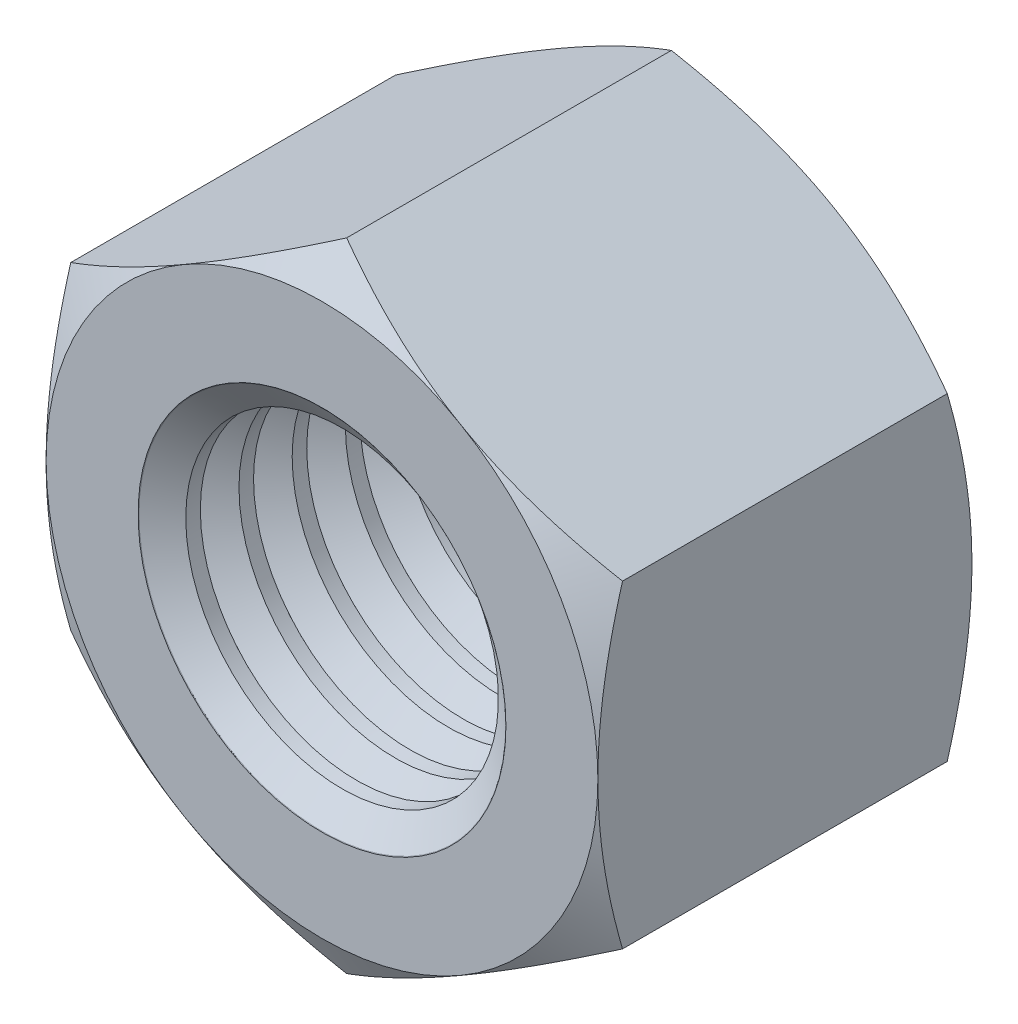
ISO-10303-21;
HEADER;
FILE_DESCRIPTION(('STEP AP214'),'2;1');
FILE_NAME('part.step','',(''),(''),'','','');
FILE_SCHEMA(('AUTOMOTIVE_DESIGN { 1 0 10303 214 1 1 1 1 }'));
ENDSEC;
DATA;
#1=APPLICATION_CONTEXT('core data for automotive mechanical design processes');
#2=APPLICATION_PROTOCOL_DEFINITION('international standard','automotive_design',2000,#1);
#3=PRODUCT_CONTEXT('',#1,'mechanical');
#4=PRODUCT('Part','Part','',(#3));
#5=PRODUCT_RELATED_PRODUCT_CATEGORY('part','',(#4));
#6=PRODUCT_DEFINITION_FORMATION('','',#4);
#7=PRODUCT_DEFINITION_CONTEXT('part definition',#1,'design');
#8=PRODUCT_DEFINITION('design','',#6,#7);
#9=PRODUCT_DEFINITION_SHAPE('','',#8);
#10=(LENGTH_UNIT() NAMED_UNIT(*) SI_UNIT(.MILLI.,.METRE.));
#11=(NAMED_UNIT(*) PLANE_ANGLE_UNIT() SI_UNIT($,.RADIAN.));
#12=(NAMED_UNIT(*) SI_UNIT($,.STERADIAN.) SOLID_ANGLE_UNIT());
#13=UNCERTAINTY_MEASURE_WITH_UNIT(LENGTH_MEASURE(1.E-05),#10,'distance_accuracy_value','');
#14=(GEOMETRIC_REPRESENTATION_CONTEXT(3) GLOBAL_UNCERTAINTY_ASSIGNED_CONTEXT((#13)) GLOBAL_UNIT_ASSIGNED_CONTEXT((#10,
#11,#12)) REPRESENTATION_CONTEXT('',''));
#15=CARTESIAN_POINT('',(0.,0.,0.));
#16=DIRECTION('',(0.,0.,1.));
#17=DIRECTION('',(1.,0.,0.));
#18=AXIS2_PLACEMENT_3D('',#15,#16,#17);
#19=CARTESIAN_POINT('',(0.,0.,-12.2));
#20=DIRECTION('',(0.,0.,1.));
#21=DIRECTION('',(1.,0.,0.));
#22=AXIS2_PLACEMENT_3D('',#19,#20,#21);
#23=CYLINDRICAL_SURFACE('',#22,5.1);
#24=CARTESIAN_POINT('',(0.,0.,-11.0691867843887));
#25=DIRECTION('',(0.,0.,-1.));
#26=DIRECTION('',(-1.,0.,0.));
#27=AXIS2_PLACEMENT_3D('',#24,#25,#26);
#28=CIRCLE('',#27,5.1);
#29=CARTESIAN_POINT('',(-5.1,0.,-11.0691867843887));
#30=VERTEX_POINT('',#29);
#31=EDGE_CURVE('E369',#30,#30,#28,.T.);
#32=ORIENTED_EDGE('',*,*,#31,.F.);
#33=EDGE_LOOP('',(#32));
#34=FACE_BOUND('',#33,.T.);
#35=CARTESIAN_POINT('',(0.,0.,-11.5444132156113));
#36=DIRECTION('',(0.,0.,-1.));
#37=DIRECTION('',(-1.,0.,0.));
#38=AXIS2_PLACEMENT_3D('',#35,#36,#37);
#39=CIRCLE('',#38,5.1);
#40=CARTESIAN_POINT('',(-5.1,0.,-11.5444132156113));
#41=VERTEX_POINT('',#40);
#42=EDGE_CURVE('E169',#41,#41,#39,.F.);
#43=ORIENTED_EDGE('',*,*,#42,.F.);
#44=EDGE_LOOP('',(#43));
#45=FACE_BOUND('',#44,.T.);
#46=ADVANCED_FACE('F26',(#34,#45),#23,.F.);
#47=CARTESIAN_POINT('',(0.,0.,-9.80881321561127));
#48=DIRECTION('',(0.,0.,-1.));
#49=DIRECTION('',(-1.,0.,0.));
#50=AXIS2_PLACEMENT_3D('',#47,#48,#49);
#51=CIRCLE('',#50,5.1);
#52=CARTESIAN_POINT('',(-5.1,0.,-9.80881321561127));
#53=VERTEX_POINT('',#52);
#54=EDGE_CURVE('E372',#53,#53,#51,.T.);
#55=ORIENTED_EDGE('',*,*,#54,.T.);
#56=EDGE_LOOP('',(#55));
#57=FACE_BOUND('',#56,.T.);
#58=CARTESIAN_POINT('',(0.,0.,-9.33358678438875));
#59=DIRECTION('',(0.,0.,-1.));
#60=DIRECTION('',(-1.,0.,0.));
#61=AXIS2_PLACEMENT_3D('',#58,#59,#60);
#62=CIRCLE('',#61,5.1);
#63=CARTESIAN_POINT('',(-5.1,0.,-9.33358678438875));
#64=VERTEX_POINT('',#63);
#65=EDGE_CURVE('E360',#64,#64,#62,.T.);
#66=ORIENTED_EDGE('',*,*,#65,.F.);
#67=EDGE_LOOP('',(#66));
#68=FACE_BOUND('',#67,.T.);
#69=ADVANCED_FACE('F288',(#57,#68),#23,.F.);
#70=CARTESIAN_POINT('',(0.,0.,-8.07321321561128));
#71=DIRECTION('',(0.,0.,-1.));
#72=DIRECTION('',(-1.,0.,0.));
#73=AXIS2_PLACEMENT_3D('',#70,#71,#72);
#74=CIRCLE('',#73,5.1);
#75=CARTESIAN_POINT('',(-5.1,0.,-8.07321321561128));
#76=VERTEX_POINT('',#75);
#77=EDGE_CURVE('E363',#76,#76,#74,.T.);
#78=ORIENTED_EDGE('',*,*,#77,.T.);
#79=EDGE_LOOP('',(#78));
#80=FACE_BOUND('',#79,.T.);
#81=CARTESIAN_POINT('',(0.,0.,-7.59798678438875));
#82=DIRECTION('',(0.,0.,-1.));
#83=DIRECTION('',(-1.,0.,0.));
#84=AXIS2_PLACEMENT_3D('',#81,#82,#83);
#85=CIRCLE('',#84,5.1);
#86=CARTESIAN_POINT('',(-5.1,0.,-7.59798678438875));
#87=VERTEX_POINT('',#86);
#88=EDGE_CURVE('E351',#87,#87,#85,.T.);
#89=ORIENTED_EDGE('',*,*,#88,.F.);
#90=EDGE_LOOP('',(#89));
#91=FACE_BOUND('',#90,.T.);
#92=ADVANCED_FACE('F295',(#80,#91),#23,.F.);
#93=CARTESIAN_POINT('',(0.,0.,-6.33761321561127));
#94=DIRECTION('',(0.,0.,-1.));
#95=DIRECTION('',(-1.,0.,0.));
#96=AXIS2_PLACEMENT_3D('',#93,#94,#95);
#97=CIRCLE('',#96,5.1);
#98=CARTESIAN_POINT('',(-5.1,0.,-6.33761321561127));
#99=VERTEX_POINT('',#98);
#100=EDGE_CURVE('E354',#99,#99,#97,.T.);
#101=ORIENTED_EDGE('',*,*,#100,.T.);
#102=EDGE_LOOP('',(#101));
#103=FACE_BOUND('',#102,.T.);
#104=CARTESIAN_POINT('',(0.,0.,-5.86238678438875));
#105=DIRECTION('',(0.,0.,-1.));
#106=DIRECTION('',(-1.,0.,0.));
#107=AXIS2_PLACEMENT_3D('',#104,#105,#106);
#108=CIRCLE('',#107,5.1);
#109=CARTESIAN_POINT('',(-5.1,0.,-5.86238678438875));
#110=VERTEX_POINT('',#109);
#111=EDGE_CURVE('E342',#110,#110,#108,.T.);
#112=ORIENTED_EDGE('',*,*,#111,.F.);
#113=EDGE_LOOP('',(#112));
#114=FACE_BOUND('',#113,.T.);
#115=ADVANCED_FACE('F600',(#103,#114),#23,.F.);
#116=CARTESIAN_POINT('',(0.,0.,-4.60201321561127));
#117=DIRECTION('',(0.,0.,-1.));
#118=DIRECTION('',(-1.,0.,0.));
#119=AXIS2_PLACEMENT_3D('',#116,#117,#118);
#120=CIRCLE('',#119,5.1);
#121=CARTESIAN_POINT('',(-5.1,0.,-4.60201321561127));
#122=VERTEX_POINT('',#121);
#123=EDGE_CURVE('E345',#122,#122,#120,.T.);
#124=ORIENTED_EDGE('',*,*,#123,.T.);
#125=EDGE_LOOP('',(#124));
#126=FACE_BOUND('',#125,.T.);
#127=CARTESIAN_POINT('',(0.,0.,-4.12678678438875));
#128=DIRECTION('',(0.,0.,-1.));
#129=DIRECTION('',(-1.,0.,0.));
#130=AXIS2_PLACEMENT_3D('',#127,#128,#129);
#131=CIRCLE('',#130,5.1);
#132=CARTESIAN_POINT('',(-5.1,0.,-4.12678678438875));
#133=VERTEX_POINT('',#132);
#134=EDGE_CURVE('E333',#133,#133,#131,.T.);
#135=ORIENTED_EDGE('',*,*,#134,.F.);
#136=EDGE_LOOP('',(#135));
#137=FACE_BOUND('',#136,.T.);
#138=ADVANCED_FACE('F309',(#126,#137),#23,.F.);
#139=CARTESIAN_POINT('',(0.,0.,-2.86641321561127));
#140=DIRECTION('',(0.,0.,-1.));
#141=DIRECTION('',(-1.,0.,0.));
#142=AXIS2_PLACEMENT_3D('',#139,#140,#141);
#143=CIRCLE('',#142,5.1);
#144=CARTESIAN_POINT('',(-5.1,0.,-2.86641321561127));
#145=VERTEX_POINT('',#144);
#146=EDGE_CURVE('E336',#145,#145,#143,.T.);
#147=ORIENTED_EDGE('',*,*,#146,.T.);
#148=EDGE_LOOP('',(#147));
#149=FACE_BOUND('',#148,.T.);
#150=CARTESIAN_POINT('',(0.,0.,-2.39118678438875));
#151=DIRECTION('',(0.,0.,-1.));
#152=DIRECTION('',(-1.,0.,0.));
#153=AXIS2_PLACEMENT_3D('',#150,#151,#152);
#154=CIRCLE('',#153,5.1);
#155=CARTESIAN_POINT('',(-5.1,0.,-2.39118678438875));
#156=VERTEX_POINT('',#155);
#157=EDGE_CURVE('E324',#156,#156,#154,.T.);
#158=ORIENTED_EDGE('',*,*,#157,.F.);
#159=EDGE_LOOP('',(#158));
#160=FACE_BOUND('',#159,.T.);
#161=ADVANCED_FACE('F300',(#149,#160),#23,.F.);
#162=CARTESIAN_POINT('',(0.,0.,-1.13081321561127));
#163=DIRECTION('',(0.,0.,-1.));
#164=DIRECTION('',(-1.,0.,0.));
#165=AXIS2_PLACEMENT_3D('',#162,#163,#164);
#166=CIRCLE('',#165,5.1);
#167=CARTESIAN_POINT('',(-5.1,0.,-1.13081321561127));
#168=VERTEX_POINT('',#167);
#169=EDGE_CURVE('E314',#168,#168,#166,.T.);
#170=ORIENTED_EDGE('',*,*,#169,.T.);
#171=EDGE_LOOP('',(#170));
#172=FACE_BOUND('',#171,.T.);
#173=CARTESIAN_POINT('',(0.,0.,-0.655586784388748));
#174=DIRECTION('',(0.,0.,-1.));
#175=DIRECTION('',(-1.,0.,0.));
#176=AXIS2_PLACEMENT_3D('',#173,#174,#175);
#177=CIRCLE('',#176,5.1);
#178=CARTESIAN_POINT('',(-5.1,0.,-0.655586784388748));
#179=VERTEX_POINT('',#178);
#180=EDGE_CURVE('E317',#179,#179,#177,.T.);
#181=ORIENTED_EDGE('',*,*,#180,.F.);
#182=EDGE_LOOP('',(#181));
#183=FACE_BOUND('',#182,.T.);
#184=ADVANCED_FACE('F290',(#172,#183),#23,.F.);
#185=CARTESIAN_POINT('',(-18.,0.,-12.2));
#186=DIRECTION('',(0.,0.,1.));
#187=DIRECTION('',(1.,0.,0.));
#188=AXIS2_PLACEMENT_3D('',#185,#186,#187);
#189=PLANE('',#188);
#190=CARTESIAN_POINT('',(0.,0.,-12.2));
#191=DIRECTION('',(0.,0.,1.));
#192=DIRECTION('',(1.,0.,0.));
#193=AXIS2_PLACEMENT_3D('',#190,#191,#192);
#194=CIRCLE('',#193,9.);
#195=CARTESIAN_POINT('',(9.,0.,-12.2));
#196=VERTEX_POINT('',#195);
#197=CARTESIAN_POINT('',(4.50000000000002,7.79422863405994,-12.2));
#198=VERTEX_POINT('',#197);
#199=EDGE_CURVE('E236',#196,#198,#194,.T.);
#200=ORIENTED_EDGE('',*,*,#199,.F.);
#201=CARTESIAN_POINT('',(0.,0.,-12.2));
#202=DIRECTION('',(0.,0.,1.));
#203=DIRECTION('',(1.,0.,0.));
#204=AXIS2_PLACEMENT_3D('',#201,#202,#203);
#205=CIRCLE('',#204,9.);
#206=CARTESIAN_POINT('',(4.50000000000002,-7.79422863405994,-12.2));
#207=VERTEX_POINT('',#206);
#208=EDGE_CURVE('E161',#196,#207,#205,.F.);
#209=ORIENTED_EDGE('',*,*,#208,.T.);
#210=CARTESIAN_POINT('',(-4.50000000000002,-7.79422863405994,-12.2));
#211=VERTEX_POINT('',#210);
#212=EDGE_CURVE('E163',#207,#211,#205,.F.);
#213=ORIENTED_EDGE('',*,*,#212,.T.);
#214=CARTESIAN_POINT('',(-9.,0.,-12.2));
#215=VERTEX_POINT('',#214);
#216=EDGE_CURVE('E505',#211,#215,#205,.F.);
#217=ORIENTED_EDGE('',*,*,#216,.T.);
#218=CARTESIAN_POINT('',(-4.50000000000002,7.79422863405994,-12.2));
#219=VERTEX_POINT('',#218);
#220=EDGE_CURVE('E526',#215,#219,#205,.F.);
#221=ORIENTED_EDGE('',*,*,#220,.T.);
#222=EDGE_CURVE('E145',#219,#198,#205,.F.);
#223=ORIENTED_EDGE('',*,*,#222,.T.);
#224=EDGE_LOOP('',(#200,#209,#213,#217,#221,#223));
#225=FACE_BOUND('',#224,.T.);
#226=CARTESIAN_POINT('',(0.,0.,-12.2));
#227=DIRECTION('',(0.,0.,1.));
#228=DIRECTION('',(1.,0.,0.));
#229=AXIS2_PLACEMENT_3D('',#226,#227,#228);
#230=CIRCLE('',#229,6.);
#231=CARTESIAN_POINT('',(6.,0.,-12.2));
#232=VERTEX_POINT('',#231);
#233=EDGE_CURVE('E167',#232,#232,#230,.F.);
#234=ORIENTED_EDGE('',*,*,#233,.F.);
#235=EDGE_LOOP('',(#234));
#236=FACE_BOUND('',#235,.T.);
#237=ADVANCED_FACE('F241',(#225,#236),#189,.F.);
#238=CARTESIAN_POINT('',(-18.,0.,0.));
#239=DIRECTION('',(0.,0.,1.));
#240=DIRECTION('',(1.,0.,0.));
#241=AXIS2_PLACEMENT_3D('',#238,#239,#240);
#242=PLANE('',#241);
#243=CARTESIAN_POINT('',(0.,0.,0.));
#244=DIRECTION('',(0.,0.,1.));
#245=DIRECTION('',(1.,0.,0.));
#246=AXIS2_PLACEMENT_3D('',#243,#244,#245);
#247=CIRCLE('',#246,9.);
#248=CARTESIAN_POINT('',(4.50000000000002,-7.79422863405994,0.));
#249=VERTEX_POINT('',#248);
#250=CARTESIAN_POINT('',(9.,0.,0.));
#251=VERTEX_POINT('',#250);
#252=EDGE_CURVE('E38',#249,#251,#247,.T.);
#253=ORIENTED_EDGE('',*,*,#252,.T.);
#254=CARTESIAN_POINT('',(0.,0.,0.));
#255=DIRECTION('',(0.,0.,1.));
#256=DIRECTION('',(1.,0.,0.));
#257=AXIS2_PLACEMENT_3D('',#254,#255,#256);
#258=CIRCLE('',#257,9.);
#259=CARTESIAN_POINT('',(4.50000000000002,7.79422863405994,0.));
#260=VERTEX_POINT('',#259);
#261=EDGE_CURVE('E45',#251,#260,#258,.T.);
#262=ORIENTED_EDGE('',*,*,#261,.T.);
#263=CARTESIAN_POINT('',(-4.50000000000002,7.79422863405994,0.));
#264=VERTEX_POINT('',#263);
#265=EDGE_CURVE('E11',#260,#264,#247,.T.);
#266=ORIENTED_EDGE('',*,*,#265,.T.);
#267=CARTESIAN_POINT('',(-9.,0.,0.));
#268=VERTEX_POINT('',#267);
#269=EDGE_CURVE('E36',#264,#268,#247,.T.);
#270=ORIENTED_EDGE('',*,*,#269,.T.);
#271=CARTESIAN_POINT('',(-4.50000000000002,-7.79422863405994,0.));
#272=VERTEX_POINT('',#271);
#273=EDGE_CURVE('E481',#268,#272,#247,.T.);
#274=ORIENTED_EDGE('',*,*,#273,.T.);
#275=EDGE_CURVE('E166',#272,#249,#247,.T.);
#276=ORIENTED_EDGE('',*,*,#275,.T.);
#277=EDGE_LOOP('',(#253,#262,#266,#270,#274,#276));
#278=FACE_BOUND('',#277,.T.);
#279=CARTESIAN_POINT('',(0.,0.,0.));
#280=DIRECTION('',(0.,0.,1.));
#281=DIRECTION('',(1.,0.,0.));
#282=AXIS2_PLACEMENT_3D('',#279,#280,#281);
#283=CIRCLE('',#282,6.);
#284=CARTESIAN_POINT('',(6.,0.,0.));
#285=VERTEX_POINT('',#284);
#286=EDGE_CURVE('E172',#285,#285,#283,.T.);
#287=ORIENTED_EDGE('',*,*,#286,.F.);
#288=EDGE_LOOP('',(#287));
#289=FACE_BOUND('',#288,.T.);
#290=ADVANCED_FACE('F307',(#278,#289),#242,.T.);
#291=CARTESIAN_POINT('',(0.,10.3923048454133,-12.2));
#292=DIRECTION('',(-0.500000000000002,0.866025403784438,0.));
#293=DIRECTION('',(-0.866025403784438,-0.500000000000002,0.));
#294=AXIS2_PLACEMENT_3D('',#291,#292,#293);
#295=PLANE('',#294);
#296=DIRECTION('',(0.,0.,1.));
#297=VECTOR('',#296,1.);
#298=CARTESIAN_POINT('',(-9.,5.19615242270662,-12.2));
#299=LINE('',#298,#297);
#300=CARTESIAN_POINT('',(-9.,5.19615242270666,-11.3961524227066));
#301=VERTEX_POINT('',#300);
#302=CARTESIAN_POINT('',(-9.,5.19615242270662,-0.803847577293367));
#303=VERTEX_POINT('',#302);
#304=EDGE_CURVE('E157',#301,#303,#299,.T.);
#305=ORIENTED_EDGE('',*,*,#304,.T.);
#306=CARTESIAN_POINT('',(-9.0002,5.19603695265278,-0.803914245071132));
#307=CARTESIAN_POINT('',(-8.80239295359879,5.31024090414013,-0.737982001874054));
#308=CARTESIAN_POINT('',(-8.60381439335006,5.42489028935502,-0.675041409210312));
#309=CARTESIAN_POINT('',(-8.20504463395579,5.65512011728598,-0.555968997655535));
#310=CARTESIAN_POINT('',(-8.00485277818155,5.77070093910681,-0.499840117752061));
#311=CARTESIAN_POINT('',(-7.6024849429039,6.00300811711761,-0.39515196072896));
#312=CARTESIAN_POINT('',(-7.40030540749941,6.11973652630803,-0.346610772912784));
#313=CARTESIAN_POINT('',(-6.99457124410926,6.35398725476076,-0.258148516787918));
#314=CARTESIAN_POINT('',(-6.79101690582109,6.47150940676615,-0.218225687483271));
#315=CARTESIAN_POINT('',(-6.38769409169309,6.70436794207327,-0.148684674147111));
#316=CARTESIAN_POINT('',(-6.187955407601,6.81968712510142,-0.118837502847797));
#317=CARTESIAN_POINT('',(-5.78758432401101,7.05084147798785,-0.0687933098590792));
#318=CARTESIAN_POINT('',(-5.5869520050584,7.16667660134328,-0.0485954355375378));
#319=CARTESIAN_POINT('',(-5.18533936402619,7.39854776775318,-0.0183543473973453));
#320=CARTESIAN_POINT('',(-4.98435969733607,7.51458343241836,-0.00829960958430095));
#321=CARTESIAN_POINT('',(-4.58221540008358,7.74676155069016,0.00143766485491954));
#322=CARTESIAN_POINT('',(-4.38105077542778,7.86290400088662,0.00112052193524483));
#323=CARTESIAN_POINT('',(-4.0049673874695,8.08003584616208,-0.00916395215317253));
#324=CARTESIAN_POINT('',(-3.83002210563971,8.18104055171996,-0.0178767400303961));
#325=CARTESIAN_POINT('',(-3.48054132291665,8.38281337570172,-0.0429773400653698));
#326=CARTESIAN_POINT('',(-3.30600585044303,8.48358147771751,-0.0593656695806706));
#327=CARTESIAN_POINT('',(-2.7830751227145,8.7854956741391,-0.119656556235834));
#328=CARTESIAN_POINT('',(-2.43560548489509,8.98610736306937,-0.174677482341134));
#329=CARTESIAN_POINT('',(-1.736980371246,9.3894587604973,-0.312230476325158));
#330=CARTESIAN_POINT('',(-1.38591405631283,9.59214699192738,-0.395345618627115));
#331=CARTESIAN_POINT('',(-0.689016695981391,9.99450087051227,-0.583982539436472));
#332=CARTESIAN_POINT('',(-0.343176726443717,10.1941716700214,-0.689460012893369));
#333=CARTESIAN_POINT('',(0.000200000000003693,10.3924203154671,-0.803914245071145));
#334=B_SPLINE_CURVE_WITH_KNOTS('',3,(#306,#307,#308,#309,#310,#311,#312,#313,#314,#315,#316,
#317,#318,#319,#320,#321,#322,#323,#324,#325,#326,#327,#328,#329,#330,#331,#332,#333),
.UNSPECIFIED.,.F.,.F.,(4,2,2,2,2,2,2,2,2,2,2,2,2,4),(0.,0.713219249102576,1.42674513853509,
2.14194697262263,2.85700253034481,3.55449749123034,4.25193080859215,4.94857085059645,
5.64518936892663,6.25162976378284,6.85811104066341,8.07193747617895,9.31268391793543,
10.5509947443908),.UNSPECIFIED.);
#335=EDGE_CURVE('E53',#303,#264,#334,.T.);
#336=ORIENTED_EDGE('',*,*,#335,.T.);
#337=CARTESIAN_POINT('',(0.,10.3923048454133,-0.80384757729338));
#338=VERTEX_POINT('',#337);
#339=EDGE_CURVE('E230',#264,#338,#334,.T.);
#340=ORIENTED_EDGE('',*,*,#339,.T.);
#341=DIRECTION('',(0.,0.,1.));
#342=VECTOR('',#341,1.);
#343=CARTESIAN_POINT('',(0.,10.3923048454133,-12.2));
#344=LINE('',#343,#342);
#345=CARTESIAN_POINT('',(0.,10.3923048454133,-11.3961524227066));
#346=VERTEX_POINT('',#345);
#347=EDGE_CURVE('E142',#346,#338,#344,.T.);
#348=ORIENTED_EDGE('',*,*,#347,.F.);
#349=CARTESIAN_POINT('',(-9.0002,5.19603695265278,-11.3960857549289));
#350=CARTESIAN_POINT('',(-8.80239295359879,5.31024090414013,-11.4620179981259));
#351=CARTESIAN_POINT('',(-8.60381439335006,5.42489028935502,-11.5249585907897));
#352=CARTESIAN_POINT('',(-8.20504463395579,5.65512011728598,-11.6440310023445));
#353=CARTESIAN_POINT('',(-8.00485277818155,5.77070093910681,-11.7001598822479));
#354=CARTESIAN_POINT('',(-7.6024849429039,6.00300811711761,-11.804848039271));
#355=CARTESIAN_POINT('',(-7.40030540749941,6.11973652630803,-11.8533892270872));
#356=CARTESIAN_POINT('',(-6.99457124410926,6.35398725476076,-11.9418514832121));
#357=CARTESIAN_POINT('',(-6.79101690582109,6.47150940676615,-11.9817743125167));
#358=CARTESIAN_POINT('',(-6.38769409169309,6.70436794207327,-12.0513153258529));
#359=CARTESIAN_POINT('',(-6.187955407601,6.81968712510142,-12.0811624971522));
#360=CARTESIAN_POINT('',(-5.78758432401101,7.05084147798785,-12.1312066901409));
#361=CARTESIAN_POINT('',(-5.5869520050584,7.16667660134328,-12.1514045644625));
#362=CARTESIAN_POINT('',(-5.18533936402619,7.39854776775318,-12.1816456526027));
#363=CARTESIAN_POINT('',(-4.98435969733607,7.51458343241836,-12.1917003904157));
#364=CARTESIAN_POINT('',(-4.58221540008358,7.74676155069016,-12.2014376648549));
#365=CARTESIAN_POINT('',(-4.38105077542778,7.86290400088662,-12.2011205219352));
#366=CARTESIAN_POINT('',(-4.0049673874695,8.08003584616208,-12.1908360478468));
#367=CARTESIAN_POINT('',(-3.83002210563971,8.18104055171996,-12.1821232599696));
#368=CARTESIAN_POINT('',(-3.48054132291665,8.38281337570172,-12.1570226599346));
#369=CARTESIAN_POINT('',(-3.30600585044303,8.48358147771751,-12.1406343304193));
#370=CARTESIAN_POINT('',(-2.7830751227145,8.7854956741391,-12.0803434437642));
#371=CARTESIAN_POINT('',(-2.43560548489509,8.98610736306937,-12.0253225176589));
#372=CARTESIAN_POINT('',(-1.736980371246,9.3894587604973,-11.8877695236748));
#373=CARTESIAN_POINT('',(-1.38591405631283,9.59214699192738,-11.8046543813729));
#374=CARTESIAN_POINT('',(-0.689016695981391,9.99450087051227,-11.6160174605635));
#375=CARTESIAN_POINT('',(-0.343176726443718,10.1941716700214,-11.5105399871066));
#376=CARTESIAN_POINT('',(0.000200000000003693,10.3924203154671,-11.3960857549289));
#377=B_SPLINE_CURVE_WITH_KNOTS('',3,(#349,#350,#351,#352,#353,#354,#355,#356,#357,#358,#359,
#360,#361,#362,#363,#364,#365,#366,#367,#368,#369,#370,#371,#372,#373,#374,#375,#376),
.UNSPECIFIED.,.F.,.F.,(4,2,2,2,2,2,2,2,2,2,2,2,2,4),(0.,0.713219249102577,1.42674513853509,
2.14194697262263,2.85700253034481,3.55449749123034,4.25193080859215,4.94857085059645,
5.64518936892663,6.25162976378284,6.85811104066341,8.07193747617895,9.31268391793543,
10.5509947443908),.UNSPECIFIED.);
#378=EDGE_CURVE('E160',#219,#346,#377,.T.);
#379=ORIENTED_EDGE('',*,*,#378,.F.);
#380=EDGE_CURVE('E251',#301,#219,#377,.T.);
#381=ORIENTED_EDGE('',*,*,#380,.F.);
#382=EDGE_LOOP('',(#305,#336,#340,#348,#379,#381));
#383=FACE_BOUND('',#382,.T.);
#384=ADVANCED_FACE('F28',(#383),#295,.T.);
#385=CARTESIAN_POINT('',(9.,5.19615242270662,-12.2));
#386=DIRECTION('',(0.500000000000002,0.866025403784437,0.));
#387=DIRECTION('',(-0.866025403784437,0.500000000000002,0.));
#388=AXIS2_PLACEMENT_3D('',#385,#386,#387);
#389=PLANE('',#388);
#390=ORIENTED_EDGE('',*,*,#347,.T.);
#391=CARTESIAN_POINT('',(-0.000199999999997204,10.3924203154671,-0.803914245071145));
#392=CARTESIAN_POINT('',(0.19760704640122,10.2782163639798,-0.737982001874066));
#393=CARTESIAN_POINT('',(0.396185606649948,10.1635669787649,-0.675041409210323));
#394=CARTESIAN_POINT('',(0.794955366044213,9.93333715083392,-0.555968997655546));
#395=CARTESIAN_POINT('',(0.995147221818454,9.81775632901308,-0.499840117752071));
#396=CARTESIAN_POINT('',(1.3975150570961,9.58544915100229,-0.395151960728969));
#397=CARTESIAN_POINT('',(1.5996945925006,9.46872074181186,-0.346610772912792));
#398=CARTESIAN_POINT('',(2.00542875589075,9.23447001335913,-0.258148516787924));
#399=CARTESIAN_POINT('',(2.20898309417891,9.11694786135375,-0.218225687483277));
#400=CARTESIAN_POINT('',(2.61230590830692,8.88408932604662,-0.148684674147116));
#401=CARTESIAN_POINT('',(2.81204459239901,8.76877014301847,-0.118837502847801));
#402=CARTESIAN_POINT('',(3.212415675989,8.53761579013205,-0.0687933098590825));
#403=CARTESIAN_POINT('',(3.41304799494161,8.42178066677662,-0.0485954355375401));
#404=CARTESIAN_POINT('',(3.81466063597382,8.18990950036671,-0.018354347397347));
#405=CARTESIAN_POINT('',(4.01564030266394,8.07387383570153,-0.00829960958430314));
#406=CARTESIAN_POINT('',(4.41778459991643,7.84169571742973,0.0014376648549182));
#407=CARTESIAN_POINT('',(4.61894922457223,7.72555326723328,0.00112052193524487));
#408=CARTESIAN_POINT('',(4.99503261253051,7.50842142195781,-0.00916395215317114));
#409=CARTESIAN_POINT('',(5.1699778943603,7.40741671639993,-0.0178767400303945));
#410=CARTESIAN_POINT('',(5.51945867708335,7.20564389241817,-0.0429773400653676));
#411=CARTESIAN_POINT('',(5.69399414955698,7.10487579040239,-0.0593656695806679));
#412=CARTESIAN_POINT('',(6.21692487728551,6.80296159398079,-0.119656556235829));
#413=CARTESIAN_POINT('',(6.56439451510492,6.60234990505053,-0.174677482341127));
#414=CARTESIAN_POINT('',(7.263019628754,6.1989985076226,-0.312230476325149));
#415=CARTESIAN_POINT('',(7.61408594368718,5.99631027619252,-0.395345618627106));
#416=CARTESIAN_POINT('',(8.31098330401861,5.59395639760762,-0.583982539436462));
#417=CARTESIAN_POINT('',(8.65682327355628,5.39428559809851,-0.689460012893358));
#418=CARTESIAN_POINT('',(9.0002,5.19603695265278,-0.803914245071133));
#419=B_SPLINE_CURVE_WITH_KNOTS('',3,(#391,#392,#393,#394,#395,#396,#397,#398,#399,#400,#401,
#402,#403,#404,#405,#406,#407,#408,#409,#410,#411,#412,#413,#414,#415,#416,#417,#418),
.UNSPECIFIED.,.F.,.F.,(4,2,2,2,2,2,2,2,2,2,2,2,2,4),(0.,0.71321924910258,1.42674513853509,
2.14194697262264,2.85700253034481,3.55449749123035,4.25193080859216,4.94857085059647,
5.64518936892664,6.25162976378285,6.85811104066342,8.07193747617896,9.31268391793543,
10.5509947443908),.UNSPECIFIED.);
#420=EDGE_CURVE('E135',#338,#260,#419,.T.);
#421=ORIENTED_EDGE('',*,*,#420,.T.);
#422=CARTESIAN_POINT('',(9.,5.19615242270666,-0.80384757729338));
#423=VERTEX_POINT('',#422);
#424=EDGE_CURVE('E121',#260,#423,#419,.T.);
#425=ORIENTED_EDGE('',*,*,#424,.T.);
#426=DIRECTION('',(0.,0.,1.));
#427=VECTOR('',#426,1.);
#428=CARTESIAN_POINT('',(9.,5.19615242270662,-12.2));
#429=LINE('',#428,#427);
#430=CARTESIAN_POINT('',(9.,5.19615242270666,-11.3961524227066));
#431=VERTEX_POINT('',#430);
#432=EDGE_CURVE('E134',#431,#423,#429,.T.);
#433=ORIENTED_EDGE('',*,*,#432,.F.);
#434=CARTESIAN_POINT('',(-0.000199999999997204,10.3924203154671,-11.3960857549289));
#435=CARTESIAN_POINT('',(0.197607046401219,10.2782163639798,-11.4620179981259));
#436=CARTESIAN_POINT('',(0.396185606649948,10.1635669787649,-11.5249585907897));
#437=CARTESIAN_POINT('',(0.794955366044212,9.93333715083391,-11.6440310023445));
#438=CARTESIAN_POINT('',(0.995147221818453,9.81775632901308,-11.7001598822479));
#439=CARTESIAN_POINT('',(1.3975150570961,9.58544915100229,-11.804848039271));
#440=CARTESIAN_POINT('',(1.5996945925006,9.46872074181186,-11.8533892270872));
#441=CARTESIAN_POINT('',(2.00542875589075,9.23447001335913,-11.9418514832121));
#442=CARTESIAN_POINT('',(2.20898309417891,9.11694786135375,-11.9817743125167));
#443=CARTESIAN_POINT('',(2.61230590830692,8.88408932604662,-12.0513153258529));
#444=CARTESIAN_POINT('',(2.81204459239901,8.76877014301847,-12.0811624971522));
#445=CARTESIAN_POINT('',(3.212415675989,8.53761579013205,-12.1312066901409));
#446=CARTESIAN_POINT('',(3.41304799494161,8.42178066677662,-12.1514045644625));
#447=CARTESIAN_POINT('',(3.81466063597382,8.18990950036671,-12.1816456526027));
#448=CARTESIAN_POINT('',(4.01564030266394,8.07387383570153,-12.1917003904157));
#449=CARTESIAN_POINT('',(4.41778459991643,7.84169571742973,-12.2014376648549));
#450=CARTESIAN_POINT('',(4.61894922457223,7.72555326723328,-12.2011205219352));
#451=CARTESIAN_POINT('',(4.99503261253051,7.50842142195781,-12.1908360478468));
#452=CARTESIAN_POINT('',(5.1699778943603,7.40741671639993,-12.1821232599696));
#453=CARTESIAN_POINT('',(5.51945867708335,7.20564389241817,-12.1570226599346));
#454=CARTESIAN_POINT('',(5.69399414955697,7.10487579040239,-12.1406343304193));
#455=CARTESIAN_POINT('',(6.21692487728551,6.80296159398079,-12.0803434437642));
#456=CARTESIAN_POINT('',(6.56439451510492,6.60234990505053,-12.0253225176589));
#457=CARTESIAN_POINT('',(7.263019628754,6.1989985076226,-11.8877695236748));
#458=CARTESIAN_POINT('',(7.61408594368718,5.99631027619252,-11.8046543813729));
#459=CARTESIAN_POINT('',(8.31098330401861,5.59395639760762,-11.6160174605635));
#460=CARTESIAN_POINT('',(8.65682327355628,5.39428559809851,-11.5105399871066));
#461=CARTESIAN_POINT('',(9.0002,5.19603695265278,-11.3960857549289));
#462=B_SPLINE_CURVE_WITH_KNOTS('',3,(#434,#435,#436,#437,#438,#439,#440,#441,#442,#443,#444,
#445,#446,#447,#448,#449,#450,#451,#452,#453,#454,#455,#456,#457,#458,#459,#460,#461),
.UNSPECIFIED.,.F.,.F.,(4,2,2,2,2,2,2,2,2,2,2,2,2,4),(0.,0.713219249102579,1.42674513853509,
2.14194697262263,2.85700253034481,3.55449749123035,4.25193080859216,4.94857085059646,
5.64518936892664,6.25162976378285,6.85811104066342,8.07193747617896,9.31268391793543,
10.5509947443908),.UNSPECIFIED.);
#463=EDGE_CURVE('E245',#198,#431,#462,.T.);
#464=ORIENTED_EDGE('',*,*,#463,.F.);
#465=EDGE_CURVE('E250',#346,#198,#462,.T.);
#466=ORIENTED_EDGE('',*,*,#465,.F.);
#467=EDGE_LOOP('',(#390,#421,#425,#433,#464,#466));
#468=FACE_BOUND('',#467,.T.);
#469=ADVANCED_FACE('F132',(#468),#389,.T.);
#470=CARTESIAN_POINT('',(9.,5.19615242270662,-12.2));
#471=DIRECTION('',(-1.,0.,0.));
#472=DIRECTION('',(0.,0.,1.));
#473=AXIS2_PLACEMENT_3D('',#470,#471,#472);
#474=PLANE('',#473);
#475=CARTESIAN_POINT('',(9.,-13.7809619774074,-4.30674034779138));
#476=CARTESIAN_POINT('',(9.,-13.5833938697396,-4.21123885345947));
#477=CARTESIAN_POINT('',(9.,-13.385586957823,-4.11623162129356));
#478=CARTESIAN_POINT('',(9.,-12.9894450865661,-3.92731913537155));
#479=CARTESIAN_POINT('',(9.,-12.7911101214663,-3.83341389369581));
#480=CARTESIAN_POINT('',(9.,-12.1951793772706,-3.55349411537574));
#481=CARTESIAN_POINT('',(9.,-11.796721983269,-3.36930666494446));
#482=CARTESIAN_POINT('',(9.,-10.9947735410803,-3.00593915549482));
#483=CARTESIAN_POINT('',(9.,-10.5912667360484,-2.82679378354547));
#484=CARTESIAN_POINT('',(9.,-9.78093737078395,-2.47619472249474));
#485=CARTESIAN_POINT('',(9.,-9.37411498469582,-2.30474063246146));
#486=CARTESIAN_POINT('',(9.,-8.55145586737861,-1.96953872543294));
#487=CARTESIAN_POINT('',(9.,-8.13556978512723,-1.80591135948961));
#488=CARTESIAN_POINT('',(9.,-7.2988933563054,-1.491471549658));
#489=CARTESIAN_POINT('',(9.,-6.87810247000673,-1.3406605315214));
#490=CARTESIAN_POINT('',(9.,-6.03180598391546,-1.05590655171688));
#491=CARTESIAN_POINT('',(9.,-5.60631258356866,-0.921927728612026));
#492=CARTESIAN_POINT('',(9.,-4.74929212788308,-0.67518705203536));
#493=CARTESIAN_POINT('',(9.,-4.31776702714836,-0.562418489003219));
#494=CARTESIAN_POINT('',(9.,-3.44831631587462,-0.363581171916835));
#495=CARTESIAN_POINT('',(9.,-3.01038903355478,-0.277519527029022));
#496=CARTESIAN_POINT('',(9.,-2.34964451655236,-0.17276642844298));
#497=CARTESIAN_POINT('',(9.,-2.12872697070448,-0.141903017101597));
#498=CARTESIAN_POINT('',(9.,-1.68585612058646,-0.0888965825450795));
#499=CARTESIAN_POINT('',(9.,-1.46390292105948,-0.0667526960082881));
#500=CARTESIAN_POINT('',(9.,-1.02066876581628,-0.0317812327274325));
#501=CARTESIAN_POINT('',(9.,-0.799392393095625,-0.0188958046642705));
#502=CARTESIAN_POINT('',(9.,-0.3564925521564,-0.00250938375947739));
#503=CARTESIAN_POINT('',(9.,-0.134869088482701,0.000991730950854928));
#504=CARTESIAN_POINT('',(9.,0.308263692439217,-0.00147389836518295));
#505=CARTESIAN_POINT('',(9.,0.529773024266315,-0.00743798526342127));
#506=CARTESIAN_POINT('',(9.,0.972347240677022,-0.02868570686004));
#507=CARTESIAN_POINT('',(9.,1.19341210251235,-0.0439698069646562));
#508=CARTESIAN_POINT('',(9.,1.72920526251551,-0.0919895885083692));
#509=CARTESIAN_POINT('',(9.,2.04352190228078,-0.12939492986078));
#510=CARTESIAN_POINT('',(9.,2.66974660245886,-0.220970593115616));
#511=CARTESIAN_POINT('',(9.,2.98165398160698,-0.275145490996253));
#512=CARTESIAN_POINT('',(9.,3.60280284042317,-0.398338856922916));
#513=CARTESIAN_POINT('',(9.,3.91204150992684,-0.467371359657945));
#514=CARTESIAN_POINT('',(9.,4.5273372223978,-0.618173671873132));
#515=CARTESIAN_POINT('',(9.,4.83339456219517,-0.699942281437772));
#516=CARTESIAN_POINT('',(9.,5.44986573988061,-0.876398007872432));
#517=CARTESIAN_POINT('',(9.,5.7602024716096,-0.971352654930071));
#518=CARTESIAN_POINT('',(9.,6.3775956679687,-1.17064401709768));
#519=CARTESIAN_POINT('',(9.,6.68465423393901,-1.27497426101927));
#520=CARTESIAN_POINT('',(9.,7.29425898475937,-1.49086177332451));
#521=CARTESIAN_POINT('',(9.,7.59682084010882,-1.60237505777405));
#522=CARTESIAN_POINT('',(9.,8.19959709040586,-1.83194682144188));
#523=CARTESIAN_POINT('',(9.,8.49981047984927,-1.95000794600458));
#524=CARTESIAN_POINT('',(9.,8.79893322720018,-2.07069526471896));
#525=B_SPLINE_CURVE_WITH_KNOTS('',3,(#475,#476,#477,#478,#479,#480,#481,#482,#483,#484,#485,
#486,#487,#488,#489,#490,#491,#492,#493,#494,#495,#496,#497,#498,#499,#500,#501,#502,#503,#504,
#505,#506,#507,#508,#509,#510,#511,#512,#513,#514,#515,#516,#517,#518,#519,#520,#521,#522,#523,
#524),.UNSPECIFIED.,.F.,.F.,(4,2,2,2,2,2,2,2,2,2,2,2,2,2,2,2,2,2,2,2,2,2,2,2,4),(0.,
0.658317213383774,1.31664163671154,2.63350462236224,3.95790348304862,5.28223322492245,
6.62282162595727,7.96355896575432,9.3013895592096,10.6387962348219,11.9765586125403,
12.6456025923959,13.3145803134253,13.9793407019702,14.644092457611,15.3086576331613,
15.9732559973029,16.9223307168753,17.8716646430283,18.82189928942,19.7720444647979,
20.745479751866,21.7182482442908,22.6855413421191,23.6532281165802),.UNSPECIFIED.);
#526=CARTESIAN_POINT('',(9.,-5.19615242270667,-0.80384757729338));
#527=VERTEX_POINT('',#526);
#528=EDGE_CURVE('E127',#527,#251,#525,.T.);
#529=ORIENTED_EDGE('',*,*,#528,.F.);
#530=DIRECTION('',(0.,0.,1.));
#531=VECTOR('',#530,1.);
#532=CARTESIAN_POINT('',(9.,-5.19615242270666,-12.2));
#533=LINE('',#532,#531);
#534=CARTESIAN_POINT('',(9.,-5.19615242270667,-11.3961524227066));
#535=VERTEX_POINT('',#534);
#536=EDGE_CURVE('E143',#535,#527,#533,.T.);
#537=ORIENTED_EDGE('',*,*,#536,.F.);
#538=CARTESIAN_POINT('',(9.,-13.7809619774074,-7.89325965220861));
#539=CARTESIAN_POINT('',(9.,-13.5833938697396,-7.98876114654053));
#540=CARTESIAN_POINT('',(9.,-13.385586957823,-8.08376837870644));
#541=CARTESIAN_POINT('',(9.,-12.9894450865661,-8.27268086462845));
#542=CARTESIAN_POINT('',(9.,-12.7911101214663,-8.36658610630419));
#543=CARTESIAN_POINT('',(9.,-12.1951793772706,-8.64650588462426));
#544=CARTESIAN_POINT('',(9.,-11.796721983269,-8.83069333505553));
#545=CARTESIAN_POINT('',(9.,-10.9947735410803,-9.19406084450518));
#546=CARTESIAN_POINT('',(9.,-10.5912667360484,-9.37320621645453));
#547=CARTESIAN_POINT('',(9.,-9.78093737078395,-9.72380527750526));
#548=CARTESIAN_POINT('',(9.,-9.37411498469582,-9.89525936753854));
#549=CARTESIAN_POINT('',(9.,-8.55145586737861,-10.2304612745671));
#550=CARTESIAN_POINT('',(9.,-8.13556978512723,-10.3940886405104));
#551=CARTESIAN_POINT('',(9.,-7.2988933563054,-10.708528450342));
#552=CARTESIAN_POINT('',(9.,-6.87810247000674,-10.8593394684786));
#553=CARTESIAN_POINT('',(9.,-6.03180598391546,-11.1440934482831));
#554=CARTESIAN_POINT('',(9.,-5.60631258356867,-11.278072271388));
#555=CARTESIAN_POINT('',(9.,-4.74929212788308,-11.5248129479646));
#556=CARTESIAN_POINT('',(9.,-4.31776702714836,-11.6375815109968));
#557=CARTESIAN_POINT('',(9.,-3.44831631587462,-11.8364188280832));
#558=CARTESIAN_POINT('',(9.,-3.01038903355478,-11.922480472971));
#559=CARTESIAN_POINT('',(9.,-2.34964451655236,-12.027233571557));
#560=CARTESIAN_POINT('',(9.,-2.12872697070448,-12.0580969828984));
#561=CARTESIAN_POINT('',(9.,-1.68585612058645,-12.1111034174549));
#562=CARTESIAN_POINT('',(9.,-1.46390292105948,-12.1332473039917));
#563=CARTESIAN_POINT('',(9.,-1.02066876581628,-12.1682187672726));
#564=CARTESIAN_POINT('',(9.,-0.799392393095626,-12.1811041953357));
#565=CARTESIAN_POINT('',(9.,-0.356492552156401,-12.1974906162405));
#566=CARTESIAN_POINT('',(9.,-0.134869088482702,-12.2009917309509));
#567=CARTESIAN_POINT('',(9.,0.308263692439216,-12.1985261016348));
#568=CARTESIAN_POINT('',(9.,0.529773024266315,-12.1925620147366));
#569=CARTESIAN_POINT('',(9.,0.972347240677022,-12.17131429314));
#570=CARTESIAN_POINT('',(9.,1.19341210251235,-12.1560301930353));
#571=CARTESIAN_POINT('',(9.,1.72920526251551,-12.1080104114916));
#572=CARTESIAN_POINT('',(9.,2.04352190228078,-12.0706050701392));
#573=CARTESIAN_POINT('',(9.,2.66974660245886,-11.9790294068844));
#574=CARTESIAN_POINT('',(9.,2.98165398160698,-11.9248545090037));
#575=CARTESIAN_POINT('',(9.,3.60280284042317,-11.8016611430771));
#576=CARTESIAN_POINT('',(9.,3.91204150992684,-11.7326286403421));
#577=CARTESIAN_POINT('',(9.,4.5273372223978,-11.5818263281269));
#578=CARTESIAN_POINT('',(9.,4.83339456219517,-11.5000577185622));
#579=CARTESIAN_POINT('',(9.,5.44986573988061,-11.3236019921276));
#580=CARTESIAN_POINT('',(9.,5.76020247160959,-11.2286473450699));
#581=CARTESIAN_POINT('',(9.,6.37759566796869,-11.0293559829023));
#582=CARTESIAN_POINT('',(9.,6.684654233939,-10.9250257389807));
#583=CARTESIAN_POINT('',(9.,7.29425898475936,-10.7091382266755));
#584=CARTESIAN_POINT('',(9.,7.59682084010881,-10.597624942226));
#585=CARTESIAN_POINT('',(9.,8.19959709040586,-10.3680531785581));
#586=CARTESIAN_POINT('',(9.,8.49981047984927,-10.2499920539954));
#587=CARTESIAN_POINT('',(9.,8.79893322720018,-10.129304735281));
#588=B_SPLINE_CURVE_WITH_KNOTS('',3,(#538,#539,#540,#541,#542,#543,#544,#545,#546,#547,#548,
#549,#550,#551,#552,#553,#554,#555,#556,#557,#558,#559,#560,#561,#562,#563,#564,#565,#566,#567,
#568,#569,#570,#571,#572,#573,#574,#575,#576,#577,#578,#579,#580,#581,#582,#583,#584,#585,#586,
#587),.UNSPECIFIED.,.F.,.F.,(4,2,2,2,2,2,2,2,2,2,2,2,2,2,2,2,2,2,2,2,2,2,2,2,4),(0.,
0.658317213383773,1.31664163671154,2.63350462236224,3.95790348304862,5.28223322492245,
6.62282162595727,7.96355896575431,9.3013895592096,10.6387962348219,11.9765586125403,
12.6456025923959,13.3145803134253,13.9793407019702,14.644092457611,15.3086576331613,
15.9732559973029,16.9223307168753,17.8716646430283,18.82189928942,19.7720444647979,
20.745479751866,21.7182482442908,22.6855413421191,23.6532281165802),.UNSPECIFIED.);
#589=EDGE_CURVE('E256',#535,#196,#588,.T.);
#590=ORIENTED_EDGE('',*,*,#589,.T.);
#591=EDGE_CURVE('E141',#196,#431,#588,.T.);
#592=ORIENTED_EDGE('',*,*,#591,.T.);
#593=ORIENTED_EDGE('',*,*,#432,.T.);
#594=EDGE_CURVE('E118',#251,#423,#525,.T.);
#595=ORIENTED_EDGE('',*,*,#594,.F.);
#596=EDGE_LOOP('',(#529,#537,#590,#592,#593,#595));
#597=FACE_BOUND('',#596,.T.);
#598=ADVANCED_FACE('F138',(#597),#474,.F.);
#599=CARTESIAN_POINT('',(0.,-10.3923048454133,-12.2));
#600=DIRECTION('',(0.500000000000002,-0.866025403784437,0.));
#601=DIRECTION('',(0.866025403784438,0.500000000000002,0.));
#602=AXIS2_PLACEMENT_3D('',#599,#600,#601);
#603=PLANE('',#602);
#604=ORIENTED_EDGE('',*,*,#536,.T.);
#605=CARTESIAN_POINT('',(9.0002,-5.19603695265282,-0.803914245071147));
#606=CARTESIAN_POINT('',(8.80239295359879,-5.31024090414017,-0.737982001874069));
#607=CARTESIAN_POINT('',(8.60381439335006,-5.42489028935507,-0.675041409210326));
#608=CARTESIAN_POINT('',(8.20504463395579,-5.65512011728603,-0.55596899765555));
#609=CARTESIAN_POINT('',(8.00485277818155,-5.77070093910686,-0.499840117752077));
#610=CARTESIAN_POINT('',(7.6024849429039,-6.00300811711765,-0.395151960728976));
#611=CARTESIAN_POINT('',(7.40030540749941,-6.11973652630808,-0.3466107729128));
#612=CARTESIAN_POINT('',(6.99457124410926,-6.35398725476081,-0.258148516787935));
#613=CARTESIAN_POINT('',(6.79101690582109,-6.4715094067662,-0.218225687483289));
#614=CARTESIAN_POINT('',(6.38769409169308,-6.70436794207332,-0.148684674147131));
#615=CARTESIAN_POINT('',(6.18795540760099,-6.81968712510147,-0.118837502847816));
#616=CARTESIAN_POINT('',(5.787584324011,-7.0508414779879,-0.0687933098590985));
#617=CARTESIAN_POINT('',(5.58695200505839,-7.16667660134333,-0.0485954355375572));
#618=CARTESIAN_POINT('',(5.18533936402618,-7.39854776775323,-0.018354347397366));
#619=CARTESIAN_POINT('',(4.98435969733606,-7.51458343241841,-0.00829960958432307));
#620=CARTESIAN_POINT('',(4.58221540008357,-7.74676155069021,0.00143766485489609));
#621=CARTESIAN_POINT('',(4.38105077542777,-7.86290400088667,0.00112052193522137));
#622=CARTESIAN_POINT('',(4.00496738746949,-8.08003584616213,-0.00916395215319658));
#623=CARTESIAN_POINT('',(3.8300221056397,-8.18104055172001,-0.0178767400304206));
#624=CARTESIAN_POINT('',(3.48054132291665,-8.38281337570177,-0.0429773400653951));
#625=CARTESIAN_POINT('',(3.30600585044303,-8.48358147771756,-0.0593656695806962));
#626=CARTESIAN_POINT('',(2.78307512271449,-8.78549567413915,-0.11965655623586));
#627=CARTESIAN_POINT('',(2.43560548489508,-8.98610736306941,-0.174677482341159));
#628=CARTESIAN_POINT('',(1.736980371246,-9.38945876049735,-0.312230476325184));
#629=CARTESIAN_POINT('',(1.38591405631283,-9.59214699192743,-0.395345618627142));
#630=CARTESIAN_POINT('',(0.689016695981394,-9.99450087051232,-0.583982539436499));
#631=CARTESIAN_POINT('',(0.343176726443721,-10.1941716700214,-0.689460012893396));
#632=CARTESIAN_POINT('',(-0.000199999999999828,-10.3924203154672,-0.803914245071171));
#633=B_SPLINE_CURVE_WITH_KNOTS('',3,(#605,#606,#607,#608,#609,#610,#611,#612,#613,#614,#615,
#616,#617,#618,#619,#620,#621,#622,#623,#624,#625,#626,#627,#628,#629,#630,#631,#632),
.UNSPECIFIED.,.F.,.F.,(4,2,2,2,2,2,2,2,2,2,2,2,2,4),(0.,0.71321924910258,1.42674513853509,
2.14194697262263,2.85700253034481,3.55449749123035,4.25193080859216,4.94857085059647,
5.64518936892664,6.25162976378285,6.85811104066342,8.07193747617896,9.31268391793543,
10.5509947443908),.UNSPECIFIED.);
#634=EDGE_CURVE('E492',#527,#249,#633,.T.);
#635=ORIENTED_EDGE('',*,*,#634,.T.);
#636=CARTESIAN_POINT('',(0.,-10.3923048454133,-0.80384757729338));
#637=VERTEX_POINT('',#636);
#638=EDGE_CURVE('E217',#249,#637,#633,.T.);
#639=ORIENTED_EDGE('',*,*,#638,.T.);
#640=DIRECTION('',(0.,0.,1.));
#641=VECTOR('',#640,1.);
#642=CARTESIAN_POINT('',(0.,-10.3923048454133,-12.2));
#643=LINE('',#642,#641);
#644=CARTESIAN_POINT('',(0.,-10.3923048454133,-11.3961524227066));
#645=VERTEX_POINT('',#644);
#646=EDGE_CURVE('E148',#645,#637,#643,.T.);
#647=ORIENTED_EDGE('',*,*,#646,.F.);
#648=CARTESIAN_POINT('',(9.0002,-5.19603695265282,-11.3960857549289));
#649=CARTESIAN_POINT('',(8.80239295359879,-5.31024090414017,-11.4620179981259));
#650=CARTESIAN_POINT('',(8.60381439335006,-5.42489028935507,-11.5249585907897));
#651=CARTESIAN_POINT('',(8.20504463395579,-5.65512011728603,-11.6440310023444));
#652=CARTESIAN_POINT('',(8.00485277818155,-5.77070093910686,-11.7001598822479));
#653=CARTESIAN_POINT('',(7.6024849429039,-6.00300811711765,-11.804848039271));
#654=CARTESIAN_POINT('',(7.4003054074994,-6.11973652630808,-11.8533892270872));
#655=CARTESIAN_POINT('',(6.99457124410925,-6.35398725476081,-11.9418514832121));
#656=CARTESIAN_POINT('',(6.79101690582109,-6.4715094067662,-11.9817743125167));
#657=CARTESIAN_POINT('',(6.38769409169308,-6.70436794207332,-12.0513153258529));
#658=CARTESIAN_POINT('',(6.18795540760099,-6.81968712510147,-12.0811624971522));
#659=CARTESIAN_POINT('',(5.787584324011,-7.0508414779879,-12.1312066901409));
#660=CARTESIAN_POINT('',(5.58695200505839,-7.16667660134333,-12.1514045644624));
#661=CARTESIAN_POINT('',(5.18533936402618,-7.39854776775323,-12.1816456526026));
#662=CARTESIAN_POINT('',(4.98435969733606,-7.51458343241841,-12.1917003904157));
#663=CARTESIAN_POINT('',(4.58221540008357,-7.74676155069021,-12.2014376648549));
#664=CARTESIAN_POINT('',(4.38105077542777,-7.86290400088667,-12.2011205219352));
#665=CARTESIAN_POINT('',(4.00496738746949,-8.08003584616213,-12.1908360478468));
#666=CARTESIAN_POINT('',(3.8300221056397,-8.18104055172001,-12.1821232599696));
#667=CARTESIAN_POINT('',(3.48054132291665,-8.38281337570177,-12.1570226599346));
#668=CARTESIAN_POINT('',(3.30600585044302,-8.48358147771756,-12.1406343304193));
#669=CARTESIAN_POINT('',(2.78307512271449,-8.78549567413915,-12.0803434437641));
#670=CARTESIAN_POINT('',(2.43560548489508,-8.98610736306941,-12.0253225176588));
#671=CARTESIAN_POINT('',(1.736980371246,-9.38945876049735,-11.8877695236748));
#672=CARTESIAN_POINT('',(1.38591405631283,-9.59214699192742,-11.8046543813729));
#673=CARTESIAN_POINT('',(0.689016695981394,-9.99450087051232,-11.6160174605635));
#674=CARTESIAN_POINT('',(0.343176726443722,-10.1941716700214,-11.5105399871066));
#675=CARTESIAN_POINT('',(-0.000199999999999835,-10.3924203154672,-11.3960857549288));
#676=B_SPLINE_CURVE_WITH_KNOTS('',3,(#648,#649,#650,#651,#652,#653,#654,#655,#656,#657,#658,
#659,#660,#661,#662,#663,#664,#665,#666,#667,#668,#669,#670,#671,#672,#673,#674,#675),
.UNSPECIFIED.,.F.,.F.,(4,2,2,2,2,2,2,2,2,2,2,2,2,4),(0.,0.71321924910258,1.42674513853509,
2.14194697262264,2.85700253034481,3.55449749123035,4.25193080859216,4.94857085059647,
5.64518936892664,6.25162976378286,6.85811104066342,8.07193747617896,9.31268391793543,
10.5509947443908),.UNSPECIFIED.);
#677=EDGE_CURVE('E262',#207,#645,#676,.T.);
#678=ORIENTED_EDGE('',*,*,#677,.F.);
#679=EDGE_CURVE('E261',#535,#207,#676,.T.);
#680=ORIENTED_EDGE('',*,*,#679,.F.);
#681=EDGE_LOOP('',(#604,#635,#639,#647,#678,#680));
#682=FACE_BOUND('',#681,.T.);
#683=ADVANCED_FACE('F272',(#682),#603,.T.);
#684=CARTESIAN_POINT('',(-9.,-5.19615242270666,-12.2));
#685=DIRECTION('',(-0.500000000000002,-0.866025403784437,0.));
#686=DIRECTION('',(0.866025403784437,-0.500000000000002,0.));
#687=AXIS2_PLACEMENT_3D('',#684,#685,#686);
#688=PLANE('',#687);
#689=ORIENTED_EDGE('',*,*,#646,.T.);
#690=CARTESIAN_POINT('',(0.000200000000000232,-10.3924203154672,-0.803914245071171));
#691=CARTESIAN_POINT('',(-0.197607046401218,-10.2782163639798,-0.737982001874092));
#692=CARTESIAN_POINT('',(-0.396185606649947,-10.1635669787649,-0.675041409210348));
#693=CARTESIAN_POINT('',(-0.794955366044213,-9.93333715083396,-0.55596899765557));
#694=CARTESIAN_POINT('',(-0.995147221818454,-9.81775632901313,-0.499840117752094));
#695=CARTESIAN_POINT('',(-1.3975150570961,-9.58544915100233,-0.395151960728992));
#696=CARTESIAN_POINT('',(-1.5996945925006,-9.46872074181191,-0.346610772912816));
#697=CARTESIAN_POINT('',(-2.00542875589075,-9.23447001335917,-0.258148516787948));
#698=CARTESIAN_POINT('',(-2.20898309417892,-9.11694786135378,-0.2182256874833));
#699=CARTESIAN_POINT('',(-2.61230590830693,-8.88408932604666,-0.148684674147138));
#700=CARTESIAN_POINT('',(-2.81204459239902,-8.76877014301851,-0.118837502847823));
#701=CARTESIAN_POINT('',(-3.21241567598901,-8.53761579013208,-0.0687933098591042));
#702=CARTESIAN_POINT('',(-3.41304799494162,-8.42178066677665,-0.0485954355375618));
#703=CARTESIAN_POINT('',(-3.81466063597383,-8.18990950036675,-0.0183543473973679));
#704=CARTESIAN_POINT('',(-4.01564030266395,-8.07387383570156,-0.00829960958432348));
#705=CARTESIAN_POINT('',(-4.41778459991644,-7.84169571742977,0.00143766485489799));
#706=CARTESIAN_POINT('',(-4.61894922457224,-7.72555326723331,0.00112052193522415));
#707=CARTESIAN_POINT('',(-4.99503261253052,-7.50842142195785,-0.00916395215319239));
#708=CARTESIAN_POINT('',(-5.16997789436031,-7.40741671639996,-0.0178767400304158));
#709=CARTESIAN_POINT('',(-5.51945867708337,-7.20564389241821,-0.0429773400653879));
#710=CARTESIAN_POINT('',(-5.69399414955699,-7.10487579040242,-0.0593656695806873));
#711=CARTESIAN_POINT('',(-6.21692487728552,-6.80296159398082,-0.119656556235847));
#712=CARTESIAN_POINT('',(-6.56439451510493,-6.60234990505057,-0.174677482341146));
#713=CARTESIAN_POINT('',(-7.26301962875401,-6.19899850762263,-0.312230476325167));
#714=CARTESIAN_POINT('',(-7.61408594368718,-5.99631027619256,-0.395345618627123));
#715=CARTESIAN_POINT('',(-8.31098330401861,-5.59395639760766,-0.583982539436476));
#716=CARTESIAN_POINT('',(-8.65682327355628,-5.39428559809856,-0.689460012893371));
#717=CARTESIAN_POINT('',(-9.0002,-5.19603695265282,-0.803914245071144));
#718=B_SPLINE_CURVE_WITH_KNOTS('',3,(#690,#691,#692,#693,#694,#695,#696,#697,#698,#699,#700,
#701,#702,#703,#704,#705,#706,#707,#708,#709,#710,#711,#712,#713,#714,#715,#716,#717),
.UNSPECIFIED.,.F.,.F.,(4,2,2,2,2,2,2,2,2,2,2,2,2,4),(0.,0.713219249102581,1.4267451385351,
2.14194697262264,2.85700253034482,3.55449749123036,4.25193080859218,4.94857085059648,
5.64518936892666,6.25162976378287,6.85811104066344,8.07193747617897,9.31268391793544,
10.5509947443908),.UNSPECIFIED.);
#719=EDGE_CURVE('E490',#637,#272,#718,.T.);
#720=ORIENTED_EDGE('',*,*,#719,.T.);
#721=CARTESIAN_POINT('',(-9.,-5.19615242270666,-0.80384757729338));
#722=VERTEX_POINT('',#721);
#723=EDGE_CURVE('E190',#272,#722,#718,.T.);
#724=ORIENTED_EDGE('',*,*,#723,.T.);
#725=DIRECTION('',(0.,0.,1.));
#726=VECTOR('',#725,1.);
#727=CARTESIAN_POINT('',(-9.,-5.19615242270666,-12.2));
#728=LINE('',#727,#726);
#729=CARTESIAN_POINT('',(-9.,-5.19615242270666,-11.3961524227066));
#730=VERTEX_POINT('',#729);
#731=EDGE_CURVE('E154',#730,#722,#728,.T.);
#732=ORIENTED_EDGE('',*,*,#731,.F.);
#733=CARTESIAN_POINT('',(0.000200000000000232,-10.3924203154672,-11.3960857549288));
#734=CARTESIAN_POINT('',(-0.197607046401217,-10.2782163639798,-11.4620179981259));
#735=CARTESIAN_POINT('',(-0.396185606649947,-10.1635669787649,-11.5249585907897));
#736=CARTESIAN_POINT('',(-0.794955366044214,-9.93333715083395,-11.6440310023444));
#737=CARTESIAN_POINT('',(-0.995147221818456,-9.81775632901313,-11.7001598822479));
#738=CARTESIAN_POINT('',(-1.39751505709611,-9.58544915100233,-11.804848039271));
#739=CARTESIAN_POINT('',(-1.59969459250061,-9.46872074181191,-11.8533892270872));
#740=CARTESIAN_POINT('',(-2.00542875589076,-9.23447001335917,-11.9418514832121));
#741=CARTESIAN_POINT('',(-2.20898309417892,-9.11694786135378,-11.9817743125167));
#742=CARTESIAN_POINT('',(-2.61230590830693,-8.88408932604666,-12.0513153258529));
#743=CARTESIAN_POINT('',(-2.81204459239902,-8.76877014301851,-12.0811624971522));
#744=CARTESIAN_POINT('',(-3.21241567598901,-8.53761579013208,-12.1312066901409));
#745=CARTESIAN_POINT('',(-3.41304799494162,-8.42178066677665,-12.1514045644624));
#746=CARTESIAN_POINT('',(-3.81466063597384,-8.18990950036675,-12.1816456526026));
#747=CARTESIAN_POINT('',(-4.01564030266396,-8.07387383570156,-12.1917003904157));
#748=CARTESIAN_POINT('',(-4.41778459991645,-7.84169571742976,-12.2014376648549));
#749=CARTESIAN_POINT('',(-4.61894922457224,-7.72555326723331,-12.2011205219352));
#750=CARTESIAN_POINT('',(-4.99503261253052,-7.50842142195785,-12.1908360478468));
#751=CARTESIAN_POINT('',(-5.16997789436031,-7.40741671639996,-12.1821232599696));
#752=CARTESIAN_POINT('',(-5.51945867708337,-7.20564389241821,-12.1570226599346));
#753=CARTESIAN_POINT('',(-5.69399414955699,-7.10487579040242,-12.1406343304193));
#754=CARTESIAN_POINT('',(-6.21692487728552,-6.80296159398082,-12.0803434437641));
#755=CARTESIAN_POINT('',(-6.56439451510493,-6.60234990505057,-12.0253225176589));
#756=CARTESIAN_POINT('',(-7.26301962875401,-6.19899850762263,-11.8877695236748));
#757=CARTESIAN_POINT('',(-7.61408594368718,-5.99631027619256,-11.8046543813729));
#758=CARTESIAN_POINT('',(-8.31098330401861,-5.59395639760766,-11.6160174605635));
#759=CARTESIAN_POINT('',(-8.65682327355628,-5.39428559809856,-11.5105399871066));
#760=CARTESIAN_POINT('',(-9.0002,-5.19603695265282,-11.3960857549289));
#761=B_SPLINE_CURVE_WITH_KNOTS('',3,(#733,#734,#735,#736,#737,#738,#739,#740,#741,#742,#743,
#744,#745,#746,#747,#748,#749,#750,#751,#752,#753,#754,#755,#756,#757,#758,#759,#760),
.UNSPECIFIED.,.F.,.F.,(4,2,2,2,2,2,2,2,2,2,2,2,2,4),(0.,0.713219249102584,1.4267451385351,
2.14194697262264,2.85700253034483,3.55449749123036,4.25193080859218,4.94857085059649,
5.64518936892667,6.25162976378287,6.85811104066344,8.07193747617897,9.31268391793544,
10.5509947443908),.UNSPECIFIED.);
#762=EDGE_CURVE('E268',#211,#730,#761,.T.);
#763=ORIENTED_EDGE('',*,*,#762,.F.);
#764=EDGE_CURVE('E267',#645,#211,#761,.T.);
#765=ORIENTED_EDGE('',*,*,#764,.F.);
#766=EDGE_LOOP('',(#689,#720,#724,#732,#763,#765));
#767=FACE_BOUND('',#766,.T.);
#768=ADVANCED_FACE('F275',(#767),#688,.T.);
#769=CARTESIAN_POINT('',(-9.,5.19615242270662,-12.2));
#770=DIRECTION('',(-1.,0.,0.));
#771=DIRECTION('',(0.,0.,1.));
#772=AXIS2_PLACEMENT_3D('',#769,#770,#771);
#773=PLANE('',#772);
#774=ORIENTED_EDGE('',*,*,#731,.T.);
#775=CARTESIAN_POINT('',(-9.,-13.7809619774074,-4.30674034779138));
#776=CARTESIAN_POINT('',(-9.,-13.5833938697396,-4.21123885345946));
#777=CARTESIAN_POINT('',(-9.,-13.385586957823,-4.11623162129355));
#778=CARTESIAN_POINT('',(-9.,-12.9894450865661,-3.92731913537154));
#779=CARTESIAN_POINT('',(-9.,-12.7911101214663,-3.8334138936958));
#780=CARTESIAN_POINT('',(-9.,-12.1951793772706,-3.55349411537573));
#781=CARTESIAN_POINT('',(-9.,-11.796721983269,-3.36930666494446));
#782=CARTESIAN_POINT('',(-9.,-10.9947735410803,-3.00593915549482));
#783=CARTESIAN_POINT('',(-9.,-10.5912667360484,-2.82679378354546));
#784=CARTESIAN_POINT('',(-9.,-9.78093737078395,-2.47619472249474));
#785=CARTESIAN_POINT('',(-9.,-9.37411498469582,-2.30474063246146));
#786=CARTESIAN_POINT('',(-9.,-8.55145586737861,-1.96953872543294));
#787=CARTESIAN_POINT('',(-9.,-8.13556978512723,-1.80591135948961));
#788=CARTESIAN_POINT('',(-9.,-7.2988933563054,-1.491471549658));
#789=CARTESIAN_POINT('',(-9.,-6.87810247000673,-1.3406605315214));
#790=CARTESIAN_POINT('',(-9.,-6.03180598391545,-1.05590655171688));
#791=CARTESIAN_POINT('',(-9.,-5.60631258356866,-0.921927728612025));
#792=CARTESIAN_POINT('',(-9.,-4.74929212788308,-0.675187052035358));
#793=CARTESIAN_POINT('',(-9.,-4.31776702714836,-0.562418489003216));
#794=CARTESIAN_POINT('',(-9.,-3.44831631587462,-0.363581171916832));
#795=CARTESIAN_POINT('',(-9.,-3.01038903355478,-0.277519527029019));
#796=CARTESIAN_POINT('',(-9.,-2.34964451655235,-0.172766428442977));
#797=CARTESIAN_POINT('',(-9.,-2.12872697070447,-0.141903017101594));
#798=CARTESIAN_POINT('',(-9.,-1.68585612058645,-0.0888965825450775));
#799=CARTESIAN_POINT('',(-9.,-1.46390292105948,-0.0667526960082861));
#800=CARTESIAN_POINT('',(-9.,-1.02066876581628,-0.0317812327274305));
#801=CARTESIAN_POINT('',(-9.,-0.79939239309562,-0.0188958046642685));
#802=CARTESIAN_POINT('',(-9.,-0.356492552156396,-0.0025093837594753));
#803=CARTESIAN_POINT('',(-9.,-0.134869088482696,0.000991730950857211));
#804=CARTESIAN_POINT('',(-9.,0.308263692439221,-0.00147389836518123));
#805=CARTESIAN_POINT('',(-9.,0.529773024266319,-0.00743798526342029));
#806=CARTESIAN_POINT('',(-9.,0.972347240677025,-0.0286857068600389));
#807=CARTESIAN_POINT('',(-9.,1.19341210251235,-0.0439698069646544));
#808=CARTESIAN_POINT('',(-9.,1.72920526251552,-0.0919895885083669));
#809=CARTESIAN_POINT('',(-9.,2.04352190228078,-0.129394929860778));
#810=CARTESIAN_POINT('',(-9.,2.66974660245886,-0.220970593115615));
#811=CARTESIAN_POINT('',(-9.,2.98165398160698,-0.275145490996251));
#812=CARTESIAN_POINT('',(-9.,3.60280284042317,-0.398338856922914));
#813=CARTESIAN_POINT('',(-9.,3.91204150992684,-0.467371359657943));
#814=CARTESIAN_POINT('',(-9.,4.52733722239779,-0.618173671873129));
#815=CARTESIAN_POINT('',(-9.,4.83339456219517,-0.699942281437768));
#816=CARTESIAN_POINT('',(-9.,5.4498657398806,-0.876398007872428));
#817=CARTESIAN_POINT('',(-9.,5.76020247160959,-0.971352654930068));
#818=CARTESIAN_POINT('',(-9.,6.37759566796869,-1.17064401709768));
#819=CARTESIAN_POINT('',(-9.,6.684654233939,-1.27497426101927));
#820=CARTESIAN_POINT('',(-9.,7.29425898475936,-1.4908617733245));
#821=CARTESIAN_POINT('',(-9.,7.59682084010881,-1.60237505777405));
#822=CARTESIAN_POINT('',(-9.,8.19959709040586,-1.83194682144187));
#823=CARTESIAN_POINT('',(-9.,8.49981047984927,-1.95000794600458));
#824=CARTESIAN_POINT('',(-9.,8.79893322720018,-2.07069526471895));
#825=B_SPLINE_CURVE_WITH_KNOTS('',3,(#775,#776,#777,#778,#779,#780,#781,#782,#783,#784,#785,
#786,#787,#788,#789,#790,#791,#792,#793,#794,#795,#796,#797,#798,#799,#800,#801,#802,#803,#804,
#805,#806,#807,#808,#809,#810,#811,#812,#813,#814,#815,#816,#817,#818,#819,#820,#821,#822,#823,
#824),.UNSPECIFIED.,.F.,.F.,(4,2,2,2,2,2,2,2,2,2,2,2,2,2,2,2,2,2,2,2,2,2,2,2,4),(0.,
0.658317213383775,1.31664163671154,2.63350462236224,3.95790348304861,5.28223322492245,
6.62282162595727,7.96355896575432,9.3013895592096,10.6387962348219,11.9765586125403,
12.6456025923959,13.3145803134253,13.9793407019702,14.644092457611,15.3086576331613,
15.9732559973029,16.9223307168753,17.8716646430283,18.82189928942,19.7720444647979,
20.745479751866,21.7182482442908,22.6855413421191,23.6532281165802),.UNSPECIFIED.);
#826=EDGE_CURVE('E189',#722,#268,#825,.T.);
#827=ORIENTED_EDGE('',*,*,#826,.T.);
#828=EDGE_CURVE('E179',#268,#303,#825,.T.);
#829=ORIENTED_EDGE('',*,*,#828,.T.);
#830=ORIENTED_EDGE('',*,*,#304,.F.);
#831=CARTESIAN_POINT('',(-9.,-13.7809619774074,-7.89325965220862));
#832=CARTESIAN_POINT('',(-9.,-13.5833938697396,-7.98876114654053));
#833=CARTESIAN_POINT('',(-9.,-13.385586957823,-8.08376837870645));
#834=CARTESIAN_POINT('',(-9.,-12.9894450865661,-8.27268086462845));
#835=CARTESIAN_POINT('',(-9.,-12.7911101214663,-8.36658610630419));
#836=CARTESIAN_POINT('',(-9.,-12.1951793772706,-8.64650588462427));
#837=CARTESIAN_POINT('',(-9.,-11.796721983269,-8.83069333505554));
#838=CARTESIAN_POINT('',(-9.,-10.9947735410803,-9.19406084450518));
#839=CARTESIAN_POINT('',(-9.,-10.5912667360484,-9.37320621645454));
#840=CARTESIAN_POINT('',(-9.,-9.78093737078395,-9.72380527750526));
#841=CARTESIAN_POINT('',(-9.,-9.37411498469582,-9.89525936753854));
#842=CARTESIAN_POINT('',(-9.,-8.55145586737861,-10.2304612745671));
#843=CARTESIAN_POINT('',(-9.,-8.13556978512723,-10.3940886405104));
#844=CARTESIAN_POINT('',(-9.,-7.2988933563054,-10.708528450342));
#845=CARTESIAN_POINT('',(-9.,-6.87810247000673,-10.8593394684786));
#846=CARTESIAN_POINT('',(-9.,-6.03180598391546,-11.1440934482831));
#847=CARTESIAN_POINT('',(-9.,-5.60631258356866,-11.278072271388));
#848=CARTESIAN_POINT('',(-9.,-4.74929212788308,-11.5248129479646));
#849=CARTESIAN_POINT('',(-9.,-4.31776702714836,-11.6375815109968));
#850=CARTESIAN_POINT('',(-9.,-3.44831631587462,-11.8364188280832));
#851=CARTESIAN_POINT('',(-9.,-3.01038903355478,-11.922480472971));
#852=CARTESIAN_POINT('',(-9.,-2.34964451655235,-12.027233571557));
#853=CARTESIAN_POINT('',(-9.,-2.12872697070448,-12.0580969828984));
#854=CARTESIAN_POINT('',(-9.,-1.68585612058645,-12.1111034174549));
#855=CARTESIAN_POINT('',(-9.,-1.46390292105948,-12.1332473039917));
#856=CARTESIAN_POINT('',(-9.,-1.02066876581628,-12.1682187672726));
#857=CARTESIAN_POINT('',(-9.,-0.799392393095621,-12.1811041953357));
#858=CARTESIAN_POINT('',(-9.,-0.356492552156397,-12.1974906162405));
#859=CARTESIAN_POINT('',(-9.,-0.134869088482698,-12.2009917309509));
#860=CARTESIAN_POINT('',(-9.,0.30826369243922,-12.1985261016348));
#861=CARTESIAN_POINT('',(-9.,0.529773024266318,-12.1925620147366));
#862=CARTESIAN_POINT('',(-9.,0.972347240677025,-12.17131429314));
#863=CARTESIAN_POINT('',(-9.,1.19341210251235,-12.1560301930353));
#864=CARTESIAN_POINT('',(-9.,1.72920526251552,-12.1080104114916));
#865=CARTESIAN_POINT('',(-9.,2.04352190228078,-12.0706050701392));
#866=CARTESIAN_POINT('',(-9.,2.66974660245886,-11.9790294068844));
#867=CARTESIAN_POINT('',(-9.,2.98165398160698,-11.9248545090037));
#868=CARTESIAN_POINT('',(-9.,3.60280284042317,-11.8016611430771));
#869=CARTESIAN_POINT('',(-9.,3.91204150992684,-11.7326286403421));
#870=CARTESIAN_POINT('',(-9.,4.52733722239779,-11.5818263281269));
#871=CARTESIAN_POINT('',(-9.,4.83339456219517,-11.5000577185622));
#872=CARTESIAN_POINT('',(-9.,5.44986573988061,-11.3236019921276));
#873=CARTESIAN_POINT('',(-9.,5.76020247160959,-11.2286473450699));
#874=CARTESIAN_POINT('',(-9.,6.37759566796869,-11.0293559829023));
#875=CARTESIAN_POINT('',(-9.,6.684654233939,-10.9250257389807));
#876=CARTESIAN_POINT('',(-9.,7.29425898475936,-10.7091382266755));
#877=CARTESIAN_POINT('',(-9.,7.59682084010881,-10.597624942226));
#878=CARTESIAN_POINT('',(-9.,8.19959709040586,-10.3680531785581));
#879=CARTESIAN_POINT('',(-9.,8.49981047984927,-10.2499920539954));
#880=CARTESIAN_POINT('',(-9.,8.79893322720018,-10.129304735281));
#881=B_SPLINE_CURVE_WITH_KNOTS('',3,(#831,#832,#833,#834,#835,#836,#837,#838,#839,#840,#841,
#842,#843,#844,#845,#846,#847,#848,#849,#850,#851,#852,#853,#854,#855,#856,#857,#858,#859,#860,
#861,#862,#863,#864,#865,#866,#867,#868,#869,#870,#871,#872,#873,#874,#875,#876,#877,#878,#879,
#880),.UNSPECIFIED.,.F.,.F.,(4,2,2,2,2,2,2,2,2,2,2,2,2,2,2,2,2,2,2,2,2,2,2,2,4),(0.,
0.658317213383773,1.31664163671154,2.63350462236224,3.95790348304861,5.28223322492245,
6.62282162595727,7.96355896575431,9.3013895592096,10.6387962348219,11.9765586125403,
12.6456025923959,13.3145803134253,13.9793407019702,14.644092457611,15.3086576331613,
15.9732559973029,16.9223307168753,17.8716646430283,18.82189928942,19.7720444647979,
20.745479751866,21.7182482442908,22.6855413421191,23.6532281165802),.UNSPECIFIED.);
#882=EDGE_CURVE('E512',#215,#301,#881,.T.);
#883=ORIENTED_EDGE('',*,*,#882,.F.);
#884=EDGE_CURVE('E513',#730,#215,#881,.T.);
#885=ORIENTED_EDGE('',*,*,#884,.F.);
#886=EDGE_LOOP('',(#774,#827,#829,#830,#883,#885));
#887=FACE_BOUND('',#886,.T.);
#888=ADVANCED_FACE('F196',(#887),#773,.T.);
#889=CARTESIAN_POINT('',(0.,0.,-12.2));
#890=DIRECTION('',(0.,0.,1.));
#891=DIRECTION('',(1.,0.,0.));
#892=AXIS2_PLACEMENT_3D('',#889,#890,#891);
#893=CONICAL_SURFACE('',#892,9.,1.0471975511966);
#894=ORIENTED_EDGE('',*,*,#463,.T.);
#895=ORIENTED_EDGE('',*,*,#591,.F.);
#896=ORIENTED_EDGE('',*,*,#199,.T.);
#897=EDGE_LOOP('',(#894,#895,#896));
#898=FACE_BOUND('',#897,.T.);
#899=ADVANCED_FACE('F285',(#898),#893,.T.);
#900=ORIENTED_EDGE('',*,*,#378,.T.);
#901=ORIENTED_EDGE('',*,*,#465,.T.);
#902=ORIENTED_EDGE('',*,*,#222,.F.);
#903=EDGE_LOOP('',(#900,#901,#902));
#904=FACE_BOUND('',#903,.T.);
#905=ADVANCED_FACE('F520',(#904),#893,.T.);
#906=ORIENTED_EDGE('',*,*,#380,.T.);
#907=ORIENTED_EDGE('',*,*,#220,.F.);
#908=ORIENTED_EDGE('',*,*,#882,.T.);
#909=EDGE_LOOP('',(#906,#907,#908));
#910=FACE_BOUND('',#909,.T.);
#911=ADVANCED_FACE('F472',(#910),#893,.T.);
#912=ORIENTED_EDGE('',*,*,#762,.T.);
#913=ORIENTED_EDGE('',*,*,#884,.T.);
#914=ORIENTED_EDGE('',*,*,#216,.F.);
#915=EDGE_LOOP('',(#912,#913,#914));
#916=FACE_BOUND('',#915,.T.);
#917=ADVANCED_FACE('F209',(#916),#893,.T.);
#918=ORIENTED_EDGE('',*,*,#677,.T.);
#919=ORIENTED_EDGE('',*,*,#764,.T.);
#920=ORIENTED_EDGE('',*,*,#212,.F.);
#921=EDGE_LOOP('',(#918,#919,#920));
#922=FACE_BOUND('',#921,.T.);
#923=ADVANCED_FACE('F470',(#922),#893,.T.);
#924=ORIENTED_EDGE('',*,*,#679,.T.);
#925=ORIENTED_EDGE('',*,*,#208,.F.);
#926=ORIENTED_EDGE('',*,*,#589,.F.);
#927=EDGE_LOOP('',(#924,#925,#926));
#928=FACE_BOUND('',#927,.T.);
#929=ADVANCED_FACE('F463',(#928),#893,.T.);
#930=CARTESIAN_POINT('',(0.,0.,0.));
#931=DIRECTION('',(0.,0.,-1.));
#932=DIRECTION('',(-1.,0.,0.));
#933=AXIS2_PLACEMENT_3D('',#930,#931,#932);
#934=CONICAL_SURFACE('',#933,9.,1.0471975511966);
#935=ORIENTED_EDGE('',*,*,#528,.T.);
#936=ORIENTED_EDGE('',*,*,#252,.F.);
#937=ORIENTED_EDGE('',*,*,#634,.F.);
#938=EDGE_LOOP('',(#935,#936,#937));
#939=FACE_BOUND('',#938,.T.);
#940=ADVANCED_FACE('F457',(#939),#934,.T.);
#941=ORIENTED_EDGE('',*,*,#275,.F.);
#942=ORIENTED_EDGE('',*,*,#719,.F.);
#943=ORIENTED_EDGE('',*,*,#638,.F.);
#944=EDGE_LOOP('',(#941,#942,#943));
#945=FACE_BOUND('',#944,.T.);
#946=ADVANCED_FACE('F204',(#945),#934,.T.);
#947=ORIENTED_EDGE('',*,*,#273,.F.);
#948=ORIENTED_EDGE('',*,*,#826,.F.);
#949=ORIENTED_EDGE('',*,*,#723,.F.);
#950=EDGE_LOOP('',(#947,#948,#949));
#951=FACE_BOUND('',#950,.T.);
#952=ADVANCED_FACE('F198',(#951),#934,.T.);
#953=ORIENTED_EDGE('',*,*,#828,.F.);
#954=ORIENTED_EDGE('',*,*,#269,.F.);
#955=ORIENTED_EDGE('',*,*,#335,.F.);
#956=EDGE_LOOP('',(#953,#954,#955));
#957=FACE_BOUND('',#956,.T.);
#958=ADVANCED_FACE('F203',(#957),#934,.T.);
#959=ORIENTED_EDGE('',*,*,#265,.F.);
#960=ORIENTED_EDGE('',*,*,#420,.F.);
#961=ORIENTED_EDGE('',*,*,#339,.F.);
#962=EDGE_LOOP('',(#959,#960,#961));
#963=FACE_BOUND('',#962,.T.);
#964=ADVANCED_FACE('F206',(#963),#934,.T.);
#965=ORIENTED_EDGE('',*,*,#261,.F.);
#966=ORIENTED_EDGE('',*,*,#594,.T.);
#967=ORIENTED_EDGE('',*,*,#424,.F.);
#968=EDGE_LOOP('',(#965,#966,#967));
#969=FACE_BOUND('',#968,.T.);
#970=ADVANCED_FACE('F120',(#969),#934,.T.);
#971=CARTESIAN_POINT('',(0.,0.,-0.693205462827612));
#972=DIRECTION('',(0.,0.,1.));
#973=DIRECTION('',(1.,0.,0.));
#974=AXIS2_PLACEMENT_3D('',#971,#972,#973);
#975=CONICAL_SURFACE('',#974,5.01,0.95993108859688);
#976=CARTESIAN_POINT('',(0.,0.,-0.0126999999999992));
#977=DIRECTION('',(0.,0.,-1.));
#978=DIRECTION('',(-1.,0.,0.));
#979=AXIS2_PLACEMENT_3D('',#976,#977,#978);
#980=CIRCLE('',#979,5.98186252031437);
#981=CARTESIAN_POINT('',(-5.98186252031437,0.,-0.0126999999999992));
#982=VERTEX_POINT('',#981);
#983=EDGE_CURVE('E31',#982,#982,#980,.F.);
#984=ORIENTED_EDGE('',*,*,#983,.F.);
#985=EDGE_LOOP('',(#984));
#986=FACE_BOUND('',#985,.T.);
#987=ORIENTED_EDGE('',*,*,#286,.T.);
#988=EDGE_LOOP('',(#987));
#989=FACE_BOUND('',#988,.T.);
#990=ADVANCED_FACE('F207',(#986,#989),#975,.F.);
#991=CARTESIAN_POINT('',(0.,0.,-12.1746));
#992=DIRECTION('',(0.,0.,-1.));
#993=DIRECTION('',(-1.,0.,0.));
#994=AXIS2_PLACEMENT_3D('',#991,#992,#993);
#995=CONICAL_SURFACE('',#994,6.,0.95993108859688);
#996=CARTESIAN_POINT('',(0.,0.,-12.1746));
#997=DIRECTION('',(0.,0.,1.));
#998=DIRECTION('',(1.,0.,0.));
#999=AXIS2_PLACEMENT_3D('',#996,#997,#998);
#1000=CIRCLE('',#999,6.);
#1001=CARTESIAN_POINT('',(6.,0.,-12.1746));
#1002=VERTEX_POINT('',#1001);
#1003=EDGE_CURVE('E170',#1002,#1002,#1000,.T.);
#1004=ORIENTED_EDGE('',*,*,#1003,.F.);
#1005=EDGE_LOOP('',(#1004));
#1006=FACE_BOUND('',#1005,.T.);
#1007=ORIENTED_EDGE('',*,*,#42,.T.);
#1008=EDGE_LOOP('',(#1007));
#1009=FACE_BOUND('',#1008,.T.);
#1010=ADVANCED_FACE('F437',(#1006,#1009),#995,.F.);
#1011=CARTESIAN_POINT('',(0.,0.,-25.0375057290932));
#1012=DIRECTION('',(0.,0.,1.));
#1013=DIRECTION('',(1.,0.,0.));
#1014=AXIS2_PLACEMENT_3D('',#1011,#1012,#1013);
#1015=CYLINDRICAL_SURFACE('',#1014,6.);
#1016=ORIENTED_EDGE('',*,*,#1003,.T.);
#1017=EDGE_LOOP('',(#1016));
#1018=FACE_BOUND('',#1017,.T.);
#1019=ORIENTED_EDGE('',*,*,#233,.T.);
#1020=EDGE_LOOP('',(#1019));
#1021=FACE_BOUND('',#1020,.T.);
#1022=ADVANCED_FACE('F435',(#1018,#1021),#1015,.F.);
#1023=CARTESIAN_POINT('',(0.,0.,-0.0254000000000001));
#1024=DIRECTION('',(0.,0.,-1.));
#1025=DIRECTION('',(-1.,0.,0.));
#1026=AXIS2_PLACEMENT_3D('',#1023,#1024,#1025);
#1027=CONICAL_SURFACE('',#1026,6.,0.959931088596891);
#1028=ORIENTED_EDGE('',*,*,#983,.T.);
#1029=EDGE_LOOP('',(#1028));
#1030=FACE_BOUND('',#1029,.T.);
#1031=CARTESIAN_POINT('',(0.,0.,-0.0254000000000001));
#1032=DIRECTION('',(0.,0.,-1.));
#1033=DIRECTION('',(-1.,0.,0.));
#1034=AXIS2_PLACEMENT_3D('',#1031,#1032,#1033);
#1035=CIRCLE('',#1034,6.);
#1036=CARTESIAN_POINT('',(-6.,0.,-0.0254000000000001));
#1037=VERTEX_POINT('',#1036);
#1038=EDGE_CURVE('E319',#1037,#1037,#1035,.T.);
#1039=ORIENTED_EDGE('',*,*,#1038,.T.);
#1040=EDGE_LOOP('',(#1039));
#1041=FACE_BOUND('',#1040,.T.);
#1042=ADVANCED_FACE('F431',(#1030,#1041),#1027,.F.);
#1043=CARTESIAN_POINT('',(0.,0.,-0.655586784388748));
#1044=DIRECTION('',(0.,0.,1.));
#1045=DIRECTION('',(1.,0.,0.));
#1046=AXIS2_PLACEMENT_3D('',#1043,#1044,#1045);
#1047=CONICAL_SURFACE('',#1046,5.1,0.959931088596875);
#1048=ORIENTED_EDGE('',*,*,#1038,.F.);
#1049=EDGE_LOOP('',(#1048));
#1050=FACE_BOUND('',#1049,.T.);
#1051=ORIENTED_EDGE('',*,*,#180,.T.);
#1052=EDGE_LOOP('',(#1051));
#1053=FACE_BOUND('',#1052,.T.);
#1054=ADVANCED_FACE('F428',(#1050,#1053),#1047,.F.);
#1055=CARTESIAN_POINT('',(0.,0.,-1.761));
#1056=DIRECTION('',(0.,0.,-1.));
#1057=DIRECTION('',(-1.,0.,0.));
#1058=AXIS2_PLACEMENT_3D('',#1055,#1056,#1057);
#1059=CONICAL_SURFACE('',#1058,6.,0.959931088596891);
#1060=ORIENTED_EDGE('',*,*,#169,.F.);
#1061=EDGE_LOOP('',(#1060));
#1062=FACE_BOUND('',#1061,.T.);
#1063=CARTESIAN_POINT('',(0.,0.,-1.761));
#1064=DIRECTION('',(0.,0.,-1.));
#1065=DIRECTION('',(-1.,0.,0.));
#1066=AXIS2_PLACEMENT_3D('',#1063,#1064,#1065);
#1067=CIRCLE('',#1066,6.);
#1068=CARTESIAN_POINT('',(-6.,0.,-1.761));
#1069=VERTEX_POINT('',#1068);
#1070=EDGE_CURVE('E320',#1069,#1069,#1067,.T.);
#1071=ORIENTED_EDGE('',*,*,#1070,.T.);
#1072=EDGE_LOOP('',(#1071));
#1073=FACE_BOUND('',#1072,.T.);
#1074=ADVANCED_FACE('F425',(#1062,#1073),#1059,.F.);
#1075=CARTESIAN_POINT('',(0.,0.,-2.39118678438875));
#1076=DIRECTION('',(0.,0.,1.));
#1077=DIRECTION('',(1.,0.,0.));
#1078=AXIS2_PLACEMENT_3D('',#1075,#1076,#1077);
#1079=CONICAL_SURFACE('',#1078,5.1,0.959931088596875);
#1080=ORIENTED_EDGE('',*,*,#1070,.F.);
#1081=EDGE_LOOP('',(#1080));
#1082=FACE_BOUND('',#1081,.T.);
#1083=ORIENTED_EDGE('',*,*,#157,.T.);
#1084=EDGE_LOOP('',(#1083));
#1085=FACE_BOUND('',#1084,.T.);
#1086=ADVANCED_FACE('F421',(#1082,#1085),#1079,.F.);
#1087=CARTESIAN_POINT('',(0.,0.,-3.4966));
#1088=DIRECTION('',(0.,0.,-1.));
#1089=DIRECTION('',(-1.,0.,0.));
#1090=AXIS2_PLACEMENT_3D('',#1087,#1088,#1089);
#1091=CONICAL_SURFACE('',#1090,6.,0.959931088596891);
#1092=ORIENTED_EDGE('',*,*,#146,.F.);
#1093=EDGE_LOOP('',(#1092));
#1094=FACE_BOUND('',#1093,.T.);
#1095=CARTESIAN_POINT('',(0.,0.,-3.4966));
#1096=DIRECTION('',(0.,0.,-1.));
#1097=DIRECTION('',(-1.,0.,0.));
#1098=AXIS2_PLACEMENT_3D('',#1095,#1096,#1097);
#1099=CIRCLE('',#1098,6.);
#1100=CARTESIAN_POINT('',(-6.,0.,-3.4966));
#1101=VERTEX_POINT('',#1100);
#1102=EDGE_CURVE('E330',#1101,#1101,#1099,.T.);
#1103=ORIENTED_EDGE('',*,*,#1102,.T.);
#1104=EDGE_LOOP('',(#1103));
#1105=FACE_BOUND('',#1104,.T.);
#1106=ADVANCED_FACE('F417',(#1094,#1105),#1091,.F.);
#1107=CARTESIAN_POINT('',(0.,0.,-4.12678678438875));
#1108=DIRECTION('',(0.,0.,1.));
#1109=DIRECTION('',(1.,0.,0.));
#1110=AXIS2_PLACEMENT_3D('',#1107,#1108,#1109);
#1111=CONICAL_SURFACE('',#1110,5.1,0.959931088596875);
#1112=ORIENTED_EDGE('',*,*,#1102,.F.);
#1113=EDGE_LOOP('',(#1112));
#1114=FACE_BOUND('',#1113,.T.);
#1115=ORIENTED_EDGE('',*,*,#134,.T.);
#1116=EDGE_LOOP('',(#1115));
#1117=FACE_BOUND('',#1116,.T.);
#1118=ADVANCED_FACE('F413',(#1114,#1117),#1111,.F.);
#1119=CARTESIAN_POINT('',(0.,0.,-5.2322));
#1120=DIRECTION('',(0.,0.,-1.));
#1121=DIRECTION('',(-1.,0.,0.));
#1122=AXIS2_PLACEMENT_3D('',#1119,#1120,#1121);
#1123=CONICAL_SURFACE('',#1122,6.,0.959931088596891);
#1124=ORIENTED_EDGE('',*,*,#123,.F.);
#1125=EDGE_LOOP('',(#1124));
#1126=FACE_BOUND('',#1125,.T.);
#1127=CARTESIAN_POINT('',(0.,0.,-5.2322));
#1128=DIRECTION('',(0.,0.,-1.));
#1129=DIRECTION('',(-1.,0.,0.));
#1130=AXIS2_PLACEMENT_3D('',#1127,#1128,#1129);
#1131=CIRCLE('',#1130,6.);
#1132=CARTESIAN_POINT('',(-6.,0.,-5.2322));
#1133=VERTEX_POINT('',#1132);
#1134=EDGE_CURVE('E339',#1133,#1133,#1131,.T.);
#1135=ORIENTED_EDGE('',*,*,#1134,.T.);
#1136=EDGE_LOOP('',(#1135));
#1137=FACE_BOUND('',#1136,.T.);
#1138=ADVANCED_FACE('F409',(#1126,#1137),#1123,.F.);
#1139=CARTESIAN_POINT('',(0.,0.,-5.86238678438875));
#1140=DIRECTION('',(0.,0.,1.));
#1141=DIRECTION('',(1.,0.,0.));
#1142=AXIS2_PLACEMENT_3D('',#1139,#1140,#1141);
#1143=CONICAL_SURFACE('',#1142,5.1,0.959931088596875);
#1144=ORIENTED_EDGE('',*,*,#1134,.F.);
#1145=EDGE_LOOP('',(#1144));
#1146=FACE_BOUND('',#1145,.T.);
#1147=ORIENTED_EDGE('',*,*,#111,.T.);
#1148=EDGE_LOOP('',(#1147));
#1149=FACE_BOUND('',#1148,.T.);
#1150=ADVANCED_FACE('F405',(#1146,#1149),#1143,.F.);
#1151=CARTESIAN_POINT('',(0.,0.,-6.9678));
#1152=DIRECTION('',(0.,0.,-1.));
#1153=DIRECTION('',(-1.,0.,0.));
#1154=AXIS2_PLACEMENT_3D('',#1151,#1152,#1153);
#1155=CONICAL_SURFACE('',#1154,6.,0.959931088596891);
#1156=ORIENTED_EDGE('',*,*,#100,.F.);
#1157=EDGE_LOOP('',(#1156));
#1158=FACE_BOUND('',#1157,.T.);
#1159=CARTESIAN_POINT('',(0.,0.,-6.9678));
#1160=DIRECTION('',(0.,0.,-1.));
#1161=DIRECTION('',(-1.,0.,0.));
#1162=AXIS2_PLACEMENT_3D('',#1159,#1160,#1161);
#1163=CIRCLE('',#1162,6.);
#1164=CARTESIAN_POINT('',(-6.,0.,-6.9678));
#1165=VERTEX_POINT('',#1164);
#1166=EDGE_CURVE('E348',#1165,#1165,#1163,.T.);
#1167=ORIENTED_EDGE('',*,*,#1166,.T.);
#1168=EDGE_LOOP('',(#1167));
#1169=FACE_BOUND('',#1168,.T.);
#1170=ADVANCED_FACE('F401',(#1158,#1169),#1155,.F.);
#1171=CARTESIAN_POINT('',(0.,0.,-7.59798678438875));
#1172=DIRECTION('',(0.,0.,1.));
#1173=DIRECTION('',(1.,0.,0.));
#1174=AXIS2_PLACEMENT_3D('',#1171,#1172,#1173);
#1175=CONICAL_SURFACE('',#1174,5.1,0.959931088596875);
#1176=ORIENTED_EDGE('',*,*,#1166,.F.);
#1177=EDGE_LOOP('',(#1176));
#1178=FACE_BOUND('',#1177,.T.);
#1179=ORIENTED_EDGE('',*,*,#88,.T.);
#1180=EDGE_LOOP('',(#1179));
#1181=FACE_BOUND('',#1180,.T.);
#1182=ADVANCED_FACE('F397',(#1178,#1181),#1175,.F.);
#1183=CARTESIAN_POINT('',(0.,0.,-8.7034));
#1184=DIRECTION('',(0.,0.,-1.));
#1185=DIRECTION('',(-1.,0.,0.));
#1186=AXIS2_PLACEMENT_3D('',#1183,#1184,#1185);
#1187=CONICAL_SURFACE('',#1186,6.,0.959931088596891);
#1188=ORIENTED_EDGE('',*,*,#77,.F.);
#1189=EDGE_LOOP('',(#1188));
#1190=FACE_BOUND('',#1189,.T.);
#1191=CARTESIAN_POINT('',(0.,0.,-8.7034));
#1192=DIRECTION('',(0.,0.,-1.));
#1193=DIRECTION('',(-1.,0.,0.));
#1194=AXIS2_PLACEMENT_3D('',#1191,#1192,#1193);
#1195=CIRCLE('',#1194,6.);
#1196=CARTESIAN_POINT('',(-6.,0.,-8.7034));
#1197=VERTEX_POINT('',#1196);
#1198=EDGE_CURVE('E357',#1197,#1197,#1195,.T.);
#1199=ORIENTED_EDGE('',*,*,#1198,.T.);
#1200=EDGE_LOOP('',(#1199));
#1201=FACE_BOUND('',#1200,.T.);
#1202=ADVANCED_FACE('F393',(#1190,#1201),#1187,.F.);
#1203=CARTESIAN_POINT('',(0.,0.,-9.33358678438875));
#1204=DIRECTION('',(0.,0.,1.));
#1205=DIRECTION('',(1.,0.,0.));
#1206=AXIS2_PLACEMENT_3D('',#1203,#1204,#1205);
#1207=CONICAL_SURFACE('',#1206,5.1,0.959931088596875);
#1208=ORIENTED_EDGE('',*,*,#1198,.F.);
#1209=EDGE_LOOP('',(#1208));
#1210=FACE_BOUND('',#1209,.T.);
#1211=ORIENTED_EDGE('',*,*,#65,.T.);
#1212=EDGE_LOOP('',(#1211));
#1213=FACE_BOUND('',#1212,.T.);
#1214=ADVANCED_FACE('F381',(#1210,#1213),#1207,.F.);
#1215=CARTESIAN_POINT('',(0.,0.,-10.439));
#1216=DIRECTION('',(0.,0.,-1.));
#1217=DIRECTION('',(-1.,0.,0.));
#1218=AXIS2_PLACEMENT_3D('',#1215,#1216,#1217);
#1219=CONICAL_SURFACE('',#1218,6.,0.959931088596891);
#1220=ORIENTED_EDGE('',*,*,#54,.F.);
#1221=EDGE_LOOP('',(#1220));
#1222=FACE_BOUND('',#1221,.T.);
#1223=CARTESIAN_POINT('',(0.,0.,-10.439));
#1224=DIRECTION('',(0.,0.,-1.));
#1225=DIRECTION('',(-1.,0.,0.));
#1226=AXIS2_PLACEMENT_3D('',#1223,#1224,#1225);
#1227=CIRCLE('',#1226,6.);
#1228=CARTESIAN_POINT('',(-6.,0.,-10.439));
#1229=VERTEX_POINT('',#1228);
#1230=EDGE_CURVE('E366',#1229,#1229,#1227,.T.);
#1231=ORIENTED_EDGE('',*,*,#1230,.T.);
#1232=EDGE_LOOP('',(#1231));
#1233=FACE_BOUND('',#1232,.T.);
#1234=ADVANCED_FACE('F377',(#1222,#1233),#1219,.F.);
#1235=CARTESIAN_POINT('',(0.,0.,-11.0691867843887));
#1236=DIRECTION('',(0.,0.,1.));
#1237=DIRECTION('',(1.,0.,0.));
#1238=AXIS2_PLACEMENT_3D('',#1235,#1236,#1237);
#1239=CONICAL_SURFACE('',#1238,5.1,0.959931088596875);
#1240=ORIENTED_EDGE('',*,*,#1230,.F.);
#1241=EDGE_LOOP('',(#1240));
#1242=FACE_BOUND('',#1241,.T.);
#1243=ORIENTED_EDGE('',*,*,#31,.T.);
#1244=EDGE_LOOP('',(#1243));
#1245=FACE_BOUND('',#1244,.T.);
#1246=ADVANCED_FACE('F380',(#1242,#1245),#1239,.F.);
#1247=CLOSED_SHELL('',(#46,#69,#92,#115,#138,#161,#184,#237,#290,#384,#469,#598,#683,#768,#888,
#899,#905,#911,#917,#923,#929,#940,#946,#952,#958,#964,#970,#990,#1010,#1022,#1042,#1054,#1074,
#1086,#1106,#1118,#1138,#1150,#1170,#1182,#1202,#1214,#1234,#1246));
#1248=MANIFOLD_SOLID_BREP('B2',#1247);
#1249=ADVANCED_BREP_SHAPE_REPRESENTATION('',(#18,#1248),#14);
#1250=SHAPE_DEFINITION_REPRESENTATION(#9,#1249);
ENDSEC;
END-ISO-10303-21;
